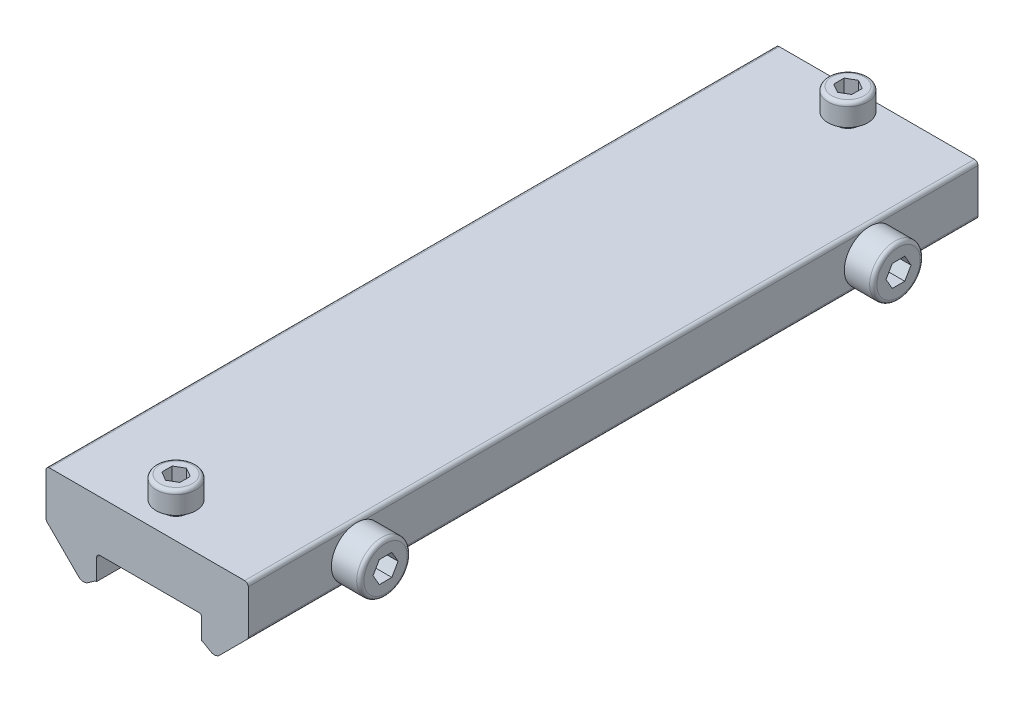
ISO-10303-21;
HEADER;
FILE_DESCRIPTION(('STEP AP214'),'2;1');
FILE_NAME('part.step','',(''),(''),'','','');
FILE_SCHEMA(('AUTOMOTIVE_DESIGN { 1 0 10303 214 1 1 1 1 }'));
ENDSEC;
DATA;
#1=APPLICATION_CONTEXT('core data for automotive mechanical design processes');
#2=APPLICATION_PROTOCOL_DEFINITION('international standard','automotive_design',2000,#1);
#3=PRODUCT_CONTEXT('',#1,'mechanical');
#4=PRODUCT('Part','Part','',(#3));
#5=PRODUCT_RELATED_PRODUCT_CATEGORY('part','',(#4));
#6=PRODUCT_DEFINITION_FORMATION('','',#4);
#7=PRODUCT_DEFINITION_CONTEXT('part definition',#1,'design');
#8=PRODUCT_DEFINITION('design','',#6,#7);
#9=PRODUCT_DEFINITION_SHAPE('','',#8);
#10=(LENGTH_UNIT() NAMED_UNIT(*) SI_UNIT(.MILLI.,.METRE.));
#11=(NAMED_UNIT(*) PLANE_ANGLE_UNIT() SI_UNIT($,.RADIAN.));
#12=(NAMED_UNIT(*) SI_UNIT($,.STERADIAN.) SOLID_ANGLE_UNIT());
#13=UNCERTAINTY_MEASURE_WITH_UNIT(LENGTH_MEASURE(1.E-05),#10,'distance_accuracy_value','');
#14=(GEOMETRIC_REPRESENTATION_CONTEXT(3) GLOBAL_UNCERTAINTY_ASSIGNED_CONTEXT((#13)) GLOBAL_UNIT_ASSIGNED_CONTEXT((#10,
#11,#12)) REPRESENTATION_CONTEXT('',''));
#15=CARTESIAN_POINT('',(0.,0.,0.));
#16=DIRECTION('',(0.,0.,1.));
#17=DIRECTION('',(1.,0.,0.));
#18=AXIS2_PLACEMENT_3D('',#15,#16,#17);
#19=CARTESIAN_POINT('',(0.5,0.,50.5));
#20=DIRECTION('',(0.,-1.,0.));
#21=DIRECTION('',(1.,0.,0.));
#22=AXIS2_PLACEMENT_3D('',#19,#20,#21);
#23=PLANE('',#22);
#24=CARTESIAN_POINT('',(-4.,0.,-46.5));
#25=DIRECTION('',(0.,-1.,0.));
#26=DIRECTION('',(1.,0.,0.));
#27=AXIS2_PLACEMENT_3D('',#24,#25,#26);
#28=CIRCLE('',#27,1.5);
#29=CARTESIAN_POINT('',(-2.5,0.,-46.5));
#30=VERTEX_POINT('',#29);
#31=EDGE_CURVE('E25',#30,#30,#28,.F.);
#32=ORIENTED_EDGE('',*,*,#31,.F.);
#33=EDGE_LOOP('',(#32));
#34=FACE_BOUND('',#33,.T.);
#35=DIRECTION('',(-1.,0.,0.));
#36=VECTOR('',#35,1.);
#37=CARTESIAN_POINT('',(0.5,0.,-50.5));
#38=LINE('',#37,#36);
#39=CARTESIAN_POINT('',(9.5,0.,-50.5));
#40=VERTEX_POINT('',#39);
#41=CARTESIAN_POINT('',(-17.5,0.,-50.5));
#42=VERTEX_POINT('',#41);
#43=EDGE_CURVE('E805',#40,#42,#38,.T.);
#44=ORIENTED_EDGE('',*,*,#43,.T.);
#45=DIRECTION('',(0.,0.,-1.));
#46=VECTOR('',#45,1.);
#47=CARTESIAN_POINT('',(-17.5,0.,50.5));
#48=LINE('',#47,#46);
#49=CARTESIAN_POINT('',(-17.5,0.,50.5));
#50=VERTEX_POINT('',#49);
#51=EDGE_CURVE('E693',#50,#42,#48,.T.);
#52=ORIENTED_EDGE('',*,*,#51,.F.);
#53=DIRECTION('',(-1.,0.,0.));
#54=VECTOR('',#53,1.);
#55=CARTESIAN_POINT('',(0.5,0.,50.5));
#56=LINE('',#55,#54);
#57=CARTESIAN_POINT('',(9.5,0.,50.5));
#58=VERTEX_POINT('',#57);
#59=EDGE_CURVE('E1066',#58,#50,#56,.T.);
#60=ORIENTED_EDGE('',*,*,#59,.F.);
#61=DIRECTION('',(0.,0.,-1.));
#62=VECTOR('',#61,1.);
#63=CARTESIAN_POINT('',(9.5,0.,50.5));
#64=LINE('',#63,#62);
#65=EDGE_CURVE('E815',#58,#40,#64,.T.);
#66=ORIENTED_EDGE('',*,*,#65,.T.);
#67=EDGE_LOOP('',(#44,#52,#60,#66));
#68=FACE_BOUND('',#67,.T.);
#69=CARTESIAN_POINT('',(-4.,0.,46.5));
#70=DIRECTION('',(0.,-1.,0.));
#71=DIRECTION('',(1.,0.,0.));
#72=AXIS2_PLACEMENT_3D('',#69,#70,#71);
#73=CIRCLE('',#72,1.5);
#74=CARTESIAN_POINT('',(-2.5,0.,46.5));
#75=VERTEX_POINT('',#74);
#76=EDGE_CURVE('E9',#75,#75,#73,.F.);
#77=ORIENTED_EDGE('',*,*,#76,.F.);
#78=EDGE_LOOP('',(#77));
#79=FACE_BOUND('',#78,.T.);
#80=ADVANCED_FACE('F16',(#34,#68,#79),#23,.F.);
#81=CARTESIAN_POINT('',(10.,-0.5,50.5));
#82=DIRECTION('',(-1.,0.,0.));
#83=DIRECTION('',(0.,-1.,0.));
#84=AXIS2_PLACEMENT_3D('',#81,#82,#83);
#85=PLANE('',#84);
#86=CARTESIAN_POINT('',(10.,-3.8,35.5));
#87=DIRECTION('',(1.,0.,0.));
#88=DIRECTION('',(0.,0.,-1.));
#89=AXIS2_PLACEMENT_3D('',#86,#87,#88);
#90=CIRCLE('',#89,3.5);
#91=CARTESIAN_POINT('',(10.,-6.50710678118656,33.2815381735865));
#92=VERTEX_POINT('',#91);
#93=CARTESIAN_POINT('',(10.,-0.5,34.3338096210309));
#94=VERTEX_POINT('',#93);
#95=EDGE_CURVE('E1116',#92,#94,#90,.T.);
#96=ORIENTED_EDGE('',*,*,#95,.F.);
#97=DIRECTION('',(0.,0.,-1.));
#98=VECTOR('',#97,1.);
#99=CARTESIAN_POINT('',(10.,-6.50710678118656,50.5));
#100=LINE('',#99,#98);
#101=CARTESIAN_POINT('',(10.,-6.50710678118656,-33.2815381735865));
#102=VERTEX_POINT('',#101);
#103=EDGE_CURVE('E829',#92,#102,#100,.T.);
#104=ORIENTED_EDGE('',*,*,#103,.T.);
#105=CARTESIAN_POINT('',(10.,-3.8,-35.5));
#106=DIRECTION('',(1.,0.,0.));
#107=DIRECTION('',(0.,0.,-1.));
#108=AXIS2_PLACEMENT_3D('',#105,#106,#107);
#109=CIRCLE('',#108,3.5);
#110=CARTESIAN_POINT('',(10.,-0.5,-34.3338096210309));
#111=VERTEX_POINT('',#110);
#112=EDGE_CURVE('E536',#111,#102,#109,.T.);
#113=ORIENTED_EDGE('',*,*,#112,.F.);
#114=DIRECTION('',(0.,0.,-1.));
#115=VECTOR('',#114,1.);
#116=CARTESIAN_POINT('',(10.,-0.5,50.5));
#117=LINE('',#116,#115);
#118=EDGE_CURVE('E824',#94,#111,#117,.T.);
#119=ORIENTED_EDGE('',*,*,#118,.F.);
#120=EDGE_LOOP('',(#96,#104,#113,#119));
#121=FACE_BOUND('',#120,.T.);
#122=ADVANCED_FACE('F720',(#121),#85,.F.);
#123=CARTESIAN_POINT('',(10.,-6.50710678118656,-37.7184618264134));
#124=VERTEX_POINT('',#123);
#125=CARTESIAN_POINT('',(10.,-0.5,-36.6661903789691));
#126=VERTEX_POINT('',#125);
#127=EDGE_CURVE('E531',#124,#126,#109,.T.);
#128=ORIENTED_EDGE('',*,*,#127,.F.);
#129=CARTESIAN_POINT('',(10.,-6.50710678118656,-50.5));
#130=VERTEX_POINT('',#129);
#131=EDGE_CURVE('E823',#124,#130,#100,.T.);
#132=ORIENTED_EDGE('',*,*,#131,.T.);
#133=DIRECTION('',(0.,1.,0.));
#134=VECTOR('',#133,1.);
#135=CARTESIAN_POINT('',(10.,-0.5,-50.5));
#136=LINE('',#135,#134);
#137=CARTESIAN_POINT('',(10.,-0.5,-50.5));
#138=VERTEX_POINT('',#137);
#139=EDGE_CURVE('E800',#130,#138,#136,.T.);
#140=ORIENTED_EDGE('',*,*,#139,.T.);
#141=EDGE_CURVE('E819',#126,#138,#117,.T.);
#142=ORIENTED_EDGE('',*,*,#141,.F.);
#143=EDGE_LOOP('',(#128,#132,#140,#142));
#144=FACE_BOUND('',#143,.T.);
#145=ADVANCED_FACE('F727',(#144),#85,.F.);
#146=CARTESIAN_POINT('',(3.7,-9.3,50.5));
#147=DIRECTION('',(0.,0.,-1.));
#148=DIRECTION('',(-1.,0.,0.));
#149=AXIS2_PLACEMENT_3D('',#146,#147,#148);
#150=CYLINDRICAL_SURFACE('',#149,0.9);
#151=CARTESIAN_POINT('',(3.7,-9.3,50.5));
#152=DIRECTION('',(0.,0.,1.));
#153=DIRECTION('',(-1.,0.,0.));
#154=AXIS2_PLACEMENT_3D('',#151,#152,#153);
#155=CIRCLE('',#154,0.9);
#156=CARTESIAN_POINT('',(3.5,-10.1774964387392,50.5));
#157=VERTEX_POINT('',#156);
#158=CARTESIAN_POINT('',(3.57142857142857,-10.1907689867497,50.5));
#159=VERTEX_POINT('',#158);
#160=EDGE_CURVE('E811',#157,#159,#155,.T.);
#161=ORIENTED_EDGE('',*,*,#160,.F.);
#162=DIRECTION('',(0.,0.,-1.));
#163=VECTOR('',#162,1.);
#164=CARTESIAN_POINT('',(3.5,-10.1774964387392,50.5));
#165=LINE('',#164,#163);
#166=CARTESIAN_POINT('',(3.5,-10.1774964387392,-50.5));
#167=VERTEX_POINT('',#166);
#168=EDGE_CURVE('E472',#157,#167,#165,.T.);
#169=ORIENTED_EDGE('',*,*,#168,.T.);
#170=CARTESIAN_POINT('',(3.7,-9.3,-50.5));
#171=DIRECTION('',(0.,0.,1.));
#172=DIRECTION('',(-1.,0.,0.));
#173=AXIS2_PLACEMENT_3D('',#170,#171,#172);
#174=CIRCLE('',#173,0.9);
#175=CARTESIAN_POINT('',(3.57142857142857,-10.1907689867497,-50.5));
#176=VERTEX_POINT('',#175);
#177=EDGE_CURVE('E780',#167,#176,#174,.T.);
#178=ORIENTED_EDGE('',*,*,#177,.T.);
#179=DIRECTION('',(0.,0.,-1.));
#180=VECTOR('',#179,1.);
#181=CARTESIAN_POINT('',(3.57142857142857,-10.1907689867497,50.5));
#182=LINE('',#181,#180);
#183=EDGE_CURVE('E775',#159,#176,#182,.T.);
#184=ORIENTED_EDGE('',*,*,#183,.F.);
#185=EDGE_LOOP('',(#161,#169,#178,#184));
#186=FACE_BOUND('',#185,.T.);
#187=ADVANCED_FACE('F18',(#186),#150,.T.);
#188=CARTESIAN_POINT('',(3.5,-10.6856406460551,50.5));
#189=DIRECTION('',(0.,0.,-1.));
#190=DIRECTION('',(-1.,0.,0.));
#191=AXIS2_PLACEMENT_3D('',#188,#189,#190);
#192=CYLINDRICAL_SURFACE('',#191,0.5);
#193=CARTESIAN_POINT('',(3.5,-10.6856406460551,-50.5));
#194=DIRECTION('',(0.,0.,-1.));
#195=DIRECTION('',(1.,0.,0.));
#196=AXIS2_PLACEMENT_3D('',#193,#194,#195);
#197=CIRCLE('',#196,0.5);
#198=CARTESIAN_POINT('',(3.75221778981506,-10.2539159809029,-50.5));
#199=VERTEX_POINT('',#198);
#200=EDGE_CURVE('E769',#176,#199,#197,.T.);
#201=ORIENTED_EDGE('',*,*,#200,.T.);
#202=DIRECTION('',(0.,0.,-1.));
#203=VECTOR('',#202,1.);
#204=CARTESIAN_POINT('',(3.75221778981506,-10.2539159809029,50.5));
#205=LINE('',#204,#203);
#206=CARTESIAN_POINT('',(3.75221778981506,-10.2539159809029,50.5));
#207=VERTEX_POINT('',#206);
#208=EDGE_CURVE('E772',#207,#199,#205,.T.);
#209=ORIENTED_EDGE('',*,*,#208,.F.);
#210=CARTESIAN_POINT('',(3.5,-10.6856406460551,50.5));
#211=DIRECTION('',(0.,0.,-1.));
#212=DIRECTION('',(1.,0.,0.));
#213=AXIS2_PLACEMENT_3D('',#210,#211,#212);
#214=CIRCLE('',#213,0.5);
#215=EDGE_CURVE('E1053',#159,#207,#214,.T.);
#216=ORIENTED_EDGE('',*,*,#215,.F.);
#217=ORIENTED_EDGE('',*,*,#183,.T.);
#218=EDGE_LOOP('',(#201,#209,#216,#217));
#219=FACE_BOUND('',#218,.T.);
#220=ADVANCED_FACE('F757',(#219),#192,.F.);
#221=CARTESIAN_POINT('',(4.79556442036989,-10.8634493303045,50.5));
#222=DIRECTION('',(0.50443557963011,0.863449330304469,0.));
#223=DIRECTION('',(-0.863449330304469,0.50443557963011,0.));
#224=AXIS2_PLACEMENT_3D('',#221,#222,#223);
#225=PLANE('',#224);
#226=DIRECTION('',(0.863449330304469,-0.50443557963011,0.));
#227=VECTOR('',#226,1.);
#228=CARTESIAN_POINT('',(4.79556442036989,-10.8634493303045,-50.5));
#229=LINE('',#228,#227);
#230=CARTESIAN_POINT('',(4.79556442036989,-10.8634493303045,-50.5));
#231=VERTEX_POINT('',#230);
#232=EDGE_CURVE('E779',#199,#231,#229,.T.);
#233=ORIENTED_EDGE('',*,*,#232,.T.);
#234=DIRECTION('',(0.,0.,-1.));
#235=VECTOR('',#234,1.);
#236=CARTESIAN_POINT('',(4.79556442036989,-10.8634493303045,50.5));
#237=LINE('',#236,#235);
#238=CARTESIAN_POINT('',(4.79556442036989,-10.8634493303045,50.5));
#239=VERTEX_POINT('',#238);
#240=EDGE_CURVE('E785',#239,#231,#237,.T.);
#241=ORIENTED_EDGE('',*,*,#240,.F.);
#242=DIRECTION('',(0.863449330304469,-0.50443557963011,0.));
#243=VECTOR('',#242,1.);
#244=CARTESIAN_POINT('',(4.79556442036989,-10.8634493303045,50.5));
#245=LINE('',#244,#243);
#246=EDGE_CURVE('E784',#207,#239,#245,.T.);
#247=ORIENTED_EDGE('',*,*,#246,.F.);
#248=ORIENTED_EDGE('',*,*,#208,.T.);
#249=EDGE_LOOP('',(#233,#241,#247,#248));
#250=FACE_BOUND('',#249,.T.);
#251=ADVANCED_FACE('F754',(#250),#225,.F.);
#252=CARTESIAN_POINT('',(5.3,-10.,50.5));
#253=DIRECTION('',(0.,0.,-1.));
#254=DIRECTION('',(-1.,0.,0.));
#255=AXIS2_PLACEMENT_3D('',#252,#253,#254);
#256=CYLINDRICAL_SURFACE('',#255,1.);
#257=CARTESIAN_POINT('',(5.3,-10.,-50.5));
#258=DIRECTION('',(0.,0.,1.));
#259=DIRECTION('',(-1.,0.,0.));
#260=AXIS2_PLACEMENT_3D('',#257,#258,#259);
#261=CIRCLE('',#260,1.);
#262=CARTESIAN_POINT('',(6.00710678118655,-10.7071067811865,-50.5));
#263=VERTEX_POINT('',#262);
#264=EDGE_CURVE('E790',#231,#263,#261,.T.);
#265=ORIENTED_EDGE('',*,*,#264,.T.);
#266=DIRECTION('',(0.,0.,-1.));
#267=VECTOR('',#266,1.);
#268=CARTESIAN_POINT('',(6.00710678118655,-10.7071067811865,50.5));
#269=LINE('',#268,#267);
#270=CARTESIAN_POINT('',(6.00710678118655,-10.7071067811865,50.5));
#271=VERTEX_POINT('',#270);
#272=EDGE_CURVE('E832',#271,#263,#269,.T.);
#273=ORIENTED_EDGE('',*,*,#272,.F.);
#274=CARTESIAN_POINT('',(5.3,-10.,50.5));
#275=DIRECTION('',(0.,0.,1.));
#276=DIRECTION('',(-1.,0.,0.));
#277=AXIS2_PLACEMENT_3D('',#274,#275,#276);
#278=CIRCLE('',#277,1.);
#279=EDGE_CURVE('E1056',#239,#271,#278,.T.);
#280=ORIENTED_EDGE('',*,*,#279,.F.);
#281=ORIENTED_EDGE('',*,*,#240,.T.);
#282=EDGE_LOOP('',(#265,#273,#280,#281));
#283=FACE_BOUND('',#282,.T.);
#284=ADVANCED_FACE('F750',(#283),#256,.T.);
#285=CARTESIAN_POINT('',(9.85355339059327,-6.86066017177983,50.5));
#286=DIRECTION('',(-0.707106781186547,0.707106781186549,0.));
#287=DIRECTION('',(-0.707106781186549,-0.707106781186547,0.));
#288=AXIS2_PLACEMENT_3D('',#285,#286,#287);
#289=PLANE('',#288);
#290=DIRECTION('',(0.707106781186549,0.707106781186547,0.));
#291=VECTOR('',#290,1.);
#292=CARTESIAN_POINT('',(9.85355339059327,-6.86066017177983,-50.5));
#293=LINE('',#292,#291);
#294=CARTESIAN_POINT('',(9.85355339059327,-6.86066017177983,-50.5));
#295=VERTEX_POINT('',#294);
#296=EDGE_CURVE('E792',#263,#295,#293,.T.);
#297=ORIENTED_EDGE('',*,*,#296,.T.);
#298=DIRECTION('',(0.,0.,-1.));
#299=VECTOR('',#298,1.);
#300=CARTESIAN_POINT('',(9.85355339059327,-6.86066017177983,50.5));
#301=LINE('',#300,#299);
#302=CARTESIAN_POINT('',(9.85355339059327,-6.86066017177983,50.5));
#303=VERTEX_POINT('',#302);
#304=EDGE_CURVE('E828',#303,#295,#301,.T.);
#305=ORIENTED_EDGE('',*,*,#304,.F.);
#306=DIRECTION('',(0.707106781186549,0.707106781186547,0.));
#307=VECTOR('',#306,1.);
#308=CARTESIAN_POINT('',(9.85355339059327,-6.86066017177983,50.5));
#309=LINE('',#308,#307);
#310=EDGE_CURVE('E1058',#271,#303,#309,.T.);
#311=ORIENTED_EDGE('',*,*,#310,.F.);
#312=ORIENTED_EDGE('',*,*,#272,.T.);
#313=EDGE_LOOP('',(#297,#305,#311,#312));
#314=FACE_BOUND('',#313,.T.);
#315=ADVANCED_FACE('F746',(#314),#289,.F.);
#316=CARTESIAN_POINT('',(9.5,-6.50710678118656,50.5));
#317=DIRECTION('',(0.,0.,-1.));
#318=DIRECTION('',(-1.,0.,0.));
#319=AXIS2_PLACEMENT_3D('',#316,#317,#318);
#320=CYLINDRICAL_SURFACE('',#319,0.5);
#321=CARTESIAN_POINT('',(9.5,-6.50710678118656,-50.5));
#322=DIRECTION('',(0.,0.,1.));
#323=DIRECTION('',(-1.,0.,0.));
#324=AXIS2_PLACEMENT_3D('',#321,#322,#323);
#325=CIRCLE('',#324,0.5);
#326=EDGE_CURVE('E797',#295,#130,#325,.T.);
#327=ORIENTED_EDGE('',*,*,#326,.T.);
#328=ORIENTED_EDGE('',*,*,#131,.F.);
#329=DIRECTION('',(0.,0.,-1.));
#330=VECTOR('',#329,1.);
#331=CARTESIAN_POINT('',(10.,-6.50710678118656,50.5));
#332=LINE('',#331,#330);
#333=EDGE_CURVE('E1041',#102,#124,#332,.T.);
#334=ORIENTED_EDGE('',*,*,#333,.F.);
#335=ORIENTED_EDGE('',*,*,#103,.F.);
#336=DIRECTION('',(0.,0.,-1.));
#337=VECTOR('',#336,1.);
#338=CARTESIAN_POINT('',(10.,-6.50710678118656,50.5));
#339=LINE('',#338,#337);
#340=CARTESIAN_POINT('',(10.,-6.50710678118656,37.7184618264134));
#341=VERTEX_POINT('',#340);
#342=EDGE_CURVE('E1044',#341,#92,#339,.T.);
#343=ORIENTED_EDGE('',*,*,#342,.F.);
#344=CARTESIAN_POINT('',(10.,-6.50710678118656,50.5));
#345=VERTEX_POINT('',#344);
#346=EDGE_CURVE('E825',#345,#341,#100,.T.);
#347=ORIENTED_EDGE('',*,*,#346,.F.);
#348=CARTESIAN_POINT('',(9.5,-6.50710678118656,50.5));
#349=DIRECTION('',(0.,0.,1.));
#350=DIRECTION('',(-1.,0.,0.));
#351=AXIS2_PLACEMENT_3D('',#348,#349,#350);
#352=CIRCLE('',#351,0.5);
#353=EDGE_CURVE('E1060',#303,#345,#352,.T.);
#354=ORIENTED_EDGE('',*,*,#353,.F.);
#355=ORIENTED_EDGE('',*,*,#304,.T.);
#356=EDGE_LOOP('',(#327,#328,#334,#335,#343,#347,#354,#355));
#357=FACE_BOUND('',#356,.T.);
#358=ADVANCED_FACE('F742',(#357),#320,.T.);
#359=CARTESIAN_POINT('',(10.,-0.5,36.6661903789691));
#360=VERTEX_POINT('',#359);
#361=EDGE_CURVE('E1107',#360,#341,#90,.T.);
#362=ORIENTED_EDGE('',*,*,#361,.F.);
#363=CARTESIAN_POINT('',(10.,-0.5,50.5));
#364=VERTEX_POINT('',#363);
#365=EDGE_CURVE('E820',#364,#360,#117,.T.);
#366=ORIENTED_EDGE('',*,*,#365,.F.);
#367=DIRECTION('',(0.,1.,0.));
#368=VECTOR('',#367,1.);
#369=CARTESIAN_POINT('',(10.,-0.5,50.5));
#370=LINE('',#369,#368);
#371=EDGE_CURVE('E1062',#345,#364,#370,.T.);
#372=ORIENTED_EDGE('',*,*,#371,.F.);
#373=ORIENTED_EDGE('',*,*,#346,.T.);
#374=EDGE_LOOP('',(#362,#366,#372,#373));
#375=FACE_BOUND('',#374,.T.);
#376=ADVANCED_FACE('F730',(#375),#85,.F.);
#377=CARTESIAN_POINT('',(9.5,-0.5,50.5));
#378=DIRECTION('',(0.,0.,-1.));
#379=DIRECTION('',(-1.,0.,0.));
#380=AXIS2_PLACEMENT_3D('',#377,#378,#379);
#381=CYLINDRICAL_SURFACE('',#380,0.5);
#382=CARTESIAN_POINT('',(9.5,-0.5,-50.5));
#383=DIRECTION('',(0.,0.,1.));
#384=DIRECTION('',(-1.,0.,0.));
#385=AXIS2_PLACEMENT_3D('',#382,#383,#384);
#386=CIRCLE('',#385,0.5);
#387=EDGE_CURVE('E803',#138,#40,#386,.T.);
#388=ORIENTED_EDGE('',*,*,#387,.T.);
#389=ORIENTED_EDGE('',*,*,#65,.F.);
#390=CARTESIAN_POINT('',(9.5,-0.5,50.5));
#391=DIRECTION('',(0.,0.,1.));
#392=DIRECTION('',(-1.,0.,0.));
#393=AXIS2_PLACEMENT_3D('',#390,#391,#392);
#394=CIRCLE('',#393,0.5);
#395=EDGE_CURVE('E1064',#364,#58,#394,.T.);
#396=ORIENTED_EDGE('',*,*,#395,.F.);
#397=ORIENTED_EDGE('',*,*,#365,.T.);
#398=DIRECTION('',(0.,0.,-1.));
#399=VECTOR('',#398,1.);
#400=CARTESIAN_POINT('',(10.,-0.5,50.5));
#401=LINE('',#400,#399);
#402=EDGE_CURVE('E935',#360,#94,#401,.T.);
#403=ORIENTED_EDGE('',*,*,#402,.T.);
#404=ORIENTED_EDGE('',*,*,#118,.T.);
#405=DIRECTION('',(0.,0.,-1.));
#406=VECTOR('',#405,1.);
#407=CARTESIAN_POINT('',(10.,-0.5,50.5));
#408=LINE('',#407,#406);
#409=EDGE_CURVE('E934',#111,#126,#408,.T.);
#410=ORIENTED_EDGE('',*,*,#409,.T.);
#411=ORIENTED_EDGE('',*,*,#141,.T.);
#412=EDGE_LOOP('',(#388,#389,#396,#397,#403,#404,#410,#411));
#413=FACE_BOUND('',#412,.T.);
#414=ADVANCED_FACE('F737',(#413),#381,.T.);
#415=CARTESIAN_POINT('',(3.,-7.3,50.5));
#416=DIRECTION('',(0.,0.,-1.));
#417=DIRECTION('',(-1.,0.,0.));
#418=AXIS2_PLACEMENT_3D('',#415,#416,#417);
#419=CYLINDRICAL_SURFACE('',#418,0.5);
#420=CARTESIAN_POINT('',(3.,-7.3,50.5));
#421=DIRECTION('',(0.,0.,-1.));
#422=DIRECTION('',(1.,0.,0.));
#423=AXIS2_PLACEMENT_3D('',#420,#421,#422);
#424=CIRCLE('',#423,0.5);
#425=CARTESIAN_POINT('',(3.4,-7.,50.5));
#426=VERTEX_POINT('',#425);
#427=CARTESIAN_POINT('',(3.5,-7.3,50.5));
#428=VERTEX_POINT('',#427);
#429=EDGE_CURVE('E1068',#426,#428,#424,.T.);
#430=ORIENTED_EDGE('',*,*,#429,.F.);
#431=DIRECTION('',(0.,0.,-1.));
#432=VECTOR('',#431,1.);
#433=CARTESIAN_POINT('',(3.4,-7.,50.5));
#434=LINE('',#433,#432);
#435=CARTESIAN_POINT('',(3.4,-7.,-50.5));
#436=VERTEX_POINT('',#435);
#437=EDGE_CURVE('E470',#426,#436,#434,.T.);
#438=ORIENTED_EDGE('',*,*,#437,.T.);
#439=CARTESIAN_POINT('',(3.,-7.3,-50.5));
#440=DIRECTION('',(0.,0.,-1.));
#441=DIRECTION('',(1.,0.,0.));
#442=AXIS2_PLACEMENT_3D('',#439,#440,#441);
#443=CIRCLE('',#442,0.5);
#444=CARTESIAN_POINT('',(3.5,-7.3,-50.5));
#445=VERTEX_POINT('',#444);
#446=EDGE_CURVE('E807',#436,#445,#443,.T.);
#447=ORIENTED_EDGE('',*,*,#446,.T.);
#448=DIRECTION('',(0.,0.,-1.));
#449=VECTOR('',#448,1.);
#450=CARTESIAN_POINT('',(3.5,-7.3,50.5));
#451=LINE('',#450,#449);
#452=EDGE_CURVE('E812',#428,#445,#451,.T.);
#453=ORIENTED_EDGE('',*,*,#452,.F.);
#454=EDGE_LOOP('',(#430,#438,#447,#453));
#455=FACE_BOUND('',#454,.T.);
#456=ADVANCED_FACE('F735',(#455),#419,.F.);
#457=CARTESIAN_POINT('',(3.5,-8.08756443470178,50.5));
#458=DIRECTION('',(1.,0.,0.));
#459=DIRECTION('',(0.,0.,-1.));
#460=AXIS2_PLACEMENT_3D('',#457,#458,#459);
#461=PLANE('',#460);
#462=DIRECTION('',(0.,-1.,0.));
#463=VECTOR('',#462,1.);
#464=CARTESIAN_POINT('',(3.5,-8.08756443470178,-50.5));
#465=LINE('',#464,#463);
#466=EDGE_CURVE('E809',#445,#167,#465,.T.);
#467=ORIENTED_EDGE('',*,*,#466,.T.);
#468=ORIENTED_EDGE('',*,*,#168,.F.);
#469=DIRECTION('',(0.,-1.,0.));
#470=VECTOR('',#469,1.);
#471=CARTESIAN_POINT('',(3.5,-8.08756443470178,50.5));
#472=LINE('',#471,#470);
#473=EDGE_CURVE('E816',#428,#157,#472,.T.);
#474=ORIENTED_EDGE('',*,*,#473,.F.);
#475=ORIENTED_EDGE('',*,*,#452,.T.);
#476=EDGE_LOOP('',(#467,#468,#474,#475));
#477=FACE_BOUND('',#476,.T.);
#478=ADVANCED_FACE('F1074',(#477),#461,.F.);
#479=CARTESIAN_POINT('',(3.,-8.08756443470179,50.5));
#480=DIRECTION('',(0.,0.,1.));
#481=DIRECTION('',(1.,0.,0.));
#482=AXIS2_PLACEMENT_3D('',#479,#480,#481);
#483=PLANE('',#482);
#484=DIRECTION('',(1.,0.,0.));
#485=VECTOR('',#484,1.);
#486=CARTESIAN_POINT('',(-4.3,-7.,50.5));
#487=LINE('',#486,#485);
#488=CARTESIAN_POINT('',(-10.5,-7.,50.5));
#489=VERTEX_POINT('',#488);
#490=EDGE_CURVE('E32',#489,#426,#487,.T.);
#491=ORIENTED_EDGE('',*,*,#490,.T.);
#492=ORIENTED_EDGE('',*,*,#429,.T.);
#493=ORIENTED_EDGE('',*,*,#473,.T.);
#494=ORIENTED_EDGE('',*,*,#160,.T.);
#495=ORIENTED_EDGE('',*,*,#215,.T.);
#496=ORIENTED_EDGE('',*,*,#246,.T.);
#497=ORIENTED_EDGE('',*,*,#279,.T.);
#498=ORIENTED_EDGE('',*,*,#310,.T.);
#499=ORIENTED_EDGE('',*,*,#353,.T.);
#500=ORIENTED_EDGE('',*,*,#371,.T.);
#501=ORIENTED_EDGE('',*,*,#395,.T.);
#502=ORIENTED_EDGE('',*,*,#59,.T.);
#503=CARTESIAN_POINT('',(-17.5,-0.5,50.5));
#504=DIRECTION('',(0.,0.,1.));
#505=DIRECTION('',(-1.,0.,0.));
#506=AXIS2_PLACEMENT_3D('',#503,#504,#505);
#507=CIRCLE('',#506,0.5);
#508=CARTESIAN_POINT('',(-18.,-0.5,50.5));
#509=VERTEX_POINT('',#508);
#510=EDGE_CURVE('E953',#50,#509,#507,.T.);
#511=ORIENTED_EDGE('',*,*,#510,.T.);
#512=DIRECTION('',(0.,-1.,0.));
#513=VECTOR('',#512,1.);
#514=CARTESIAN_POINT('',(-18.,-6.30710678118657,50.5));
#515=LINE('',#514,#513);
#516=CARTESIAN_POINT('',(-18.,-6.30710678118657,50.5));
#517=VERTEX_POINT('',#516);
#518=EDGE_CURVE('E1020',#509,#517,#515,.T.);
#519=ORIENTED_EDGE('',*,*,#518,.T.);
#520=CARTESIAN_POINT('',(-17.5,-6.30710678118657,50.5));
#521=DIRECTION('',(0.,0.,1.));
#522=DIRECTION('',(-1.,0.,0.));
#523=AXIS2_PLACEMENT_3D('',#520,#521,#522);
#524=CIRCLE('',#523,0.5);
#525=CARTESIAN_POINT('',(-17.8535533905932,-6.66066017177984,50.5));
#526=VERTEX_POINT('',#525);
#527=EDGE_CURVE('E1018',#517,#526,#524,.T.);
#528=ORIENTED_EDGE('',*,*,#527,.T.);
#529=DIRECTION('',(0.707106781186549,-0.707106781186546,0.));
#530=VECTOR('',#529,1.);
#531=CARTESIAN_POINT('',(-13.5071067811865,-11.0071067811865,50.5));
#532=LINE('',#531,#530);
#533=CARTESIAN_POINT('',(-13.5071067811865,-11.0071067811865,50.5));
#534=VERTEX_POINT('',#533);
#535=EDGE_CURVE('E1016',#526,#534,#532,.T.);
#536=ORIENTED_EDGE('',*,*,#535,.T.);
#537=CARTESIAN_POINT('',(-12.8,-10.3,50.5));
#538=DIRECTION('',(0.,0.,1.));
#539=DIRECTION('',(-1.,0.,0.));
#540=AXIS2_PLACEMENT_3D('',#537,#538,#539);
#541=CIRCLE('',#540,1.);
#542=CARTESIAN_POINT('',(-12.226423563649,-11.119152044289,50.5));
#543=VERTEX_POINT('',#542);
#544=EDGE_CURVE('E1014',#534,#543,#541,.T.);
#545=ORIENTED_EDGE('',*,*,#544,.T.);
#546=DIRECTION('',(0.819152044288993,0.573576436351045,0.));
#547=VECTOR('',#546,1.);
#548=CARTESIAN_POINT('',(-11.313051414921,-10.4796019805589,50.5));
#549=LINE('',#548,#547);
#550=CARTESIAN_POINT('',(-11.313051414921,-10.4796019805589,50.5));
#551=VERTEX_POINT('',#550);
#552=EDGE_CURVE('E1012',#543,#551,#549,.T.);
#553=ORIENTED_EDGE('',*,*,#552,.T.);
#554=CARTESIAN_POINT('',(-11.0262631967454,-10.8891780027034,50.5));
#555=DIRECTION('',(0.,0.,-1.));
#556=DIRECTION('',(1.,0.,0.));
#557=AXIS2_PLACEMENT_3D('',#554,#555,#556);
#558=CIRCLE('',#557,0.5);
#559=CARTESIAN_POINT('',(-11.0883120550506,-10.3930430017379,50.5));
#560=VERTEX_POINT('',#559);
#561=EDGE_CURVE('E1010',#551,#560,#558,.T.);
#562=ORIENTED_EDGE('',*,*,#561,.T.);
#563=CARTESIAN_POINT('',(-11.2,-9.5,50.5));
#564=DIRECTION('',(0.,0.,1.));
#565=DIRECTION('',(-1.,0.,0.));
#566=AXIS2_PLACEMENT_3D('',#563,#564,#565);
#567=CIRCLE('',#566,0.9);
#568=CARTESIAN_POINT('',(-11.,-10.3774964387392,50.5));
#569=VERTEX_POINT('',#568);
#570=EDGE_CURVE('E1007',#560,#569,#567,.T.);
#571=ORIENTED_EDGE('',*,*,#570,.T.);
#572=DIRECTION('',(0.,1.,0.));
#573=VECTOR('',#572,1.);
#574=CARTESIAN_POINT('',(-11.,-7.5,50.5));
#575=LINE('',#574,#573);
#576=CARTESIAN_POINT('',(-11.,-7.5,50.5));
#577=VERTEX_POINT('',#576);
#578=EDGE_CURVE('E1005',#569,#577,#575,.T.);
#579=ORIENTED_EDGE('',*,*,#578,.T.);
#580=CARTESIAN_POINT('',(-10.5,-7.5,50.5));
#581=DIRECTION('',(0.,0.,-1.));
#582=DIRECTION('',(1.,0.,0.));
#583=AXIS2_PLACEMENT_3D('',#580,#581,#582);
#584=CIRCLE('',#583,0.5);
#585=EDGE_CURVE('E1003',#577,#489,#584,.T.);
#586=ORIENTED_EDGE('',*,*,#585,.T.);
#587=EDGE_LOOP('',(#491,#492,#493,#494,#495,#496,#497,#498,#499,#500,#501,#502,#511,#519,#528,
#536,#545,#553,#562,#571,#579,#586));
#588=FACE_BOUND('',#587,.T.);
#589=ADVANCED_FACE('F1101',(#588),#483,.T.);
#590=CARTESIAN_POINT('',(3.,-8.08756443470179,-50.5));
#591=DIRECTION('',(0.,0.,1.));
#592=DIRECTION('',(1.,0.,0.));
#593=AXIS2_PLACEMENT_3D('',#590,#591,#592);
#594=PLANE('',#593);
#595=ORIENTED_EDGE('',*,*,#446,.F.);
#596=DIRECTION('',(1.,0.,0.));
#597=VECTOR('',#596,1.);
#598=CARTESIAN_POINT('',(-4.3,-7.,-50.5));
#599=LINE('',#598,#597);
#600=CARTESIAN_POINT('',(-10.5,-7.,-50.5));
#601=VERTEX_POINT('',#600);
#602=EDGE_CURVE('E40',#601,#436,#599,.T.);
#603=ORIENTED_EDGE('',*,*,#602,.F.);
#604=CARTESIAN_POINT('',(-10.5,-7.5,-50.5));
#605=DIRECTION('',(0.,0.,-1.));
#606=DIRECTION('',(1.,0.,0.));
#607=AXIS2_PLACEMENT_3D('',#604,#605,#606);
#608=CIRCLE('',#607,0.5);
#609=CARTESIAN_POINT('',(-11.,-7.5,-50.5));
#610=VERTEX_POINT('',#609);
#611=EDGE_CURVE('E981',#610,#601,#608,.T.);
#612=ORIENTED_EDGE('',*,*,#611,.F.);
#613=DIRECTION('',(0.,1.,0.));
#614=VECTOR('',#613,1.);
#615=CARTESIAN_POINT('',(-11.,-7.5,-50.5));
#616=LINE('',#615,#614);
#617=CARTESIAN_POINT('',(-11.,-10.3774964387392,-50.5));
#618=VERTEX_POINT('',#617);
#619=EDGE_CURVE('E983',#618,#610,#616,.T.);
#620=ORIENTED_EDGE('',*,*,#619,.F.);
#621=CARTESIAN_POINT('',(-11.2,-9.5,-50.5));
#622=DIRECTION('',(0.,0.,1.));
#623=DIRECTION('',(-1.,0.,0.));
#624=AXIS2_PLACEMENT_3D('',#621,#622,#623);
#625=CIRCLE('',#624,0.9);
#626=CARTESIAN_POINT('',(-11.0883120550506,-10.3930430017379,-50.5));
#627=VERTEX_POINT('',#626);
#628=EDGE_CURVE('E985',#627,#618,#625,.T.);
#629=ORIENTED_EDGE('',*,*,#628,.F.);
#630=CARTESIAN_POINT('',(-11.0262631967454,-10.8891780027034,-50.5));
#631=DIRECTION('',(0.,0.,-1.));
#632=DIRECTION('',(1.,0.,0.));
#633=AXIS2_PLACEMENT_3D('',#630,#631,#632);
#634=CIRCLE('',#633,0.5);
#635=CARTESIAN_POINT('',(-11.313051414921,-10.4796019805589,-50.5));
#636=VERTEX_POINT('',#635);
#637=EDGE_CURVE('E988',#636,#627,#634,.T.);
#638=ORIENTED_EDGE('',*,*,#637,.F.);
#639=DIRECTION('',(0.819152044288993,0.573576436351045,0.));
#640=VECTOR('',#639,1.);
#641=CARTESIAN_POINT('',(-11.313051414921,-10.4796019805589,-50.5));
#642=LINE('',#641,#640);
#643=CARTESIAN_POINT('',(-12.226423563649,-11.119152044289,-50.5));
#644=VERTEX_POINT('',#643);
#645=EDGE_CURVE('E990',#644,#636,#642,.T.);
#646=ORIENTED_EDGE('',*,*,#645,.F.);
#647=CARTESIAN_POINT('',(-12.8,-10.3,-50.5));
#648=DIRECTION('',(0.,0.,1.));
#649=DIRECTION('',(-1.,0.,0.));
#650=AXIS2_PLACEMENT_3D('',#647,#648,#649);
#651=CIRCLE('',#650,1.);
#652=CARTESIAN_POINT('',(-13.5071067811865,-11.0071067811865,-50.5));
#653=VERTEX_POINT('',#652);
#654=EDGE_CURVE('E992',#653,#644,#651,.T.);
#655=ORIENTED_EDGE('',*,*,#654,.F.);
#656=DIRECTION('',(0.707106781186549,-0.707106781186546,0.));
#657=VECTOR('',#656,1.);
#658=CARTESIAN_POINT('',(-13.5071067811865,-11.0071067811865,-50.5));
#659=LINE('',#658,#657);
#660=CARTESIAN_POINT('',(-17.8535533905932,-6.66066017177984,-50.5));
#661=VERTEX_POINT('',#660);
#662=EDGE_CURVE('E994',#661,#653,#659,.T.);
#663=ORIENTED_EDGE('',*,*,#662,.F.);
#664=CARTESIAN_POINT('',(-17.5,-6.30710678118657,-50.5));
#665=DIRECTION('',(0.,0.,1.));
#666=DIRECTION('',(-1.,0.,0.));
#667=AXIS2_PLACEMENT_3D('',#664,#665,#666);
#668=CIRCLE('',#667,0.5);
#669=CARTESIAN_POINT('',(-18.,-6.30710678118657,-50.5));
#670=VERTEX_POINT('',#669);
#671=EDGE_CURVE('E996',#670,#661,#668,.T.);
#672=ORIENTED_EDGE('',*,*,#671,.F.);
#673=DIRECTION('',(0.,-1.,0.));
#674=VECTOR('',#673,1.);
#675=CARTESIAN_POINT('',(-18.,-6.30710678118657,-50.5));
#676=LINE('',#675,#674);
#677=CARTESIAN_POINT('',(-18.,-0.5,-50.5));
#678=VERTEX_POINT('',#677);
#679=EDGE_CURVE('E998',#678,#670,#676,.T.);
#680=ORIENTED_EDGE('',*,*,#679,.F.);
#681=CARTESIAN_POINT('',(-17.5,-0.5,-50.5));
#682=DIRECTION('',(0.,0.,1.));
#683=DIRECTION('',(-1.,0.,0.));
#684=AXIS2_PLACEMENT_3D('',#681,#682,#683);
#685=CIRCLE('',#684,0.5);
#686=EDGE_CURVE('E945',#42,#678,#685,.T.);
#687=ORIENTED_EDGE('',*,*,#686,.F.);
#688=ORIENTED_EDGE('',*,*,#43,.F.);
#689=ORIENTED_EDGE('',*,*,#387,.F.);
#690=ORIENTED_EDGE('',*,*,#139,.F.);
#691=ORIENTED_EDGE('',*,*,#326,.F.);
#692=ORIENTED_EDGE('',*,*,#296,.F.);
#693=ORIENTED_EDGE('',*,*,#264,.F.);
#694=ORIENTED_EDGE('',*,*,#232,.F.);
#695=ORIENTED_EDGE('',*,*,#200,.F.);
#696=ORIENTED_EDGE('',*,*,#177,.F.);
#697=ORIENTED_EDGE('',*,*,#466,.F.);
#698=EDGE_LOOP('',(#595,#603,#612,#620,#629,#638,#646,#655,#663,#672,#680,#687,#688,#689,#690,
#691,#692,#693,#694,#695,#696,#697));
#699=FACE_BOUND('',#698,.T.);
#700=ADVANCED_FACE('F618',(#699),#594,.F.);
#701=CARTESIAN_POINT('',(-17.5,-0.5,50.5));
#702=DIRECTION('',(0.,0.,-1.));
#703=DIRECTION('',(-1.,0.,0.));
#704=AXIS2_PLACEMENT_3D('',#701,#702,#703);
#705=CYLINDRICAL_SURFACE('',#704,0.5);
#706=ORIENTED_EDGE('',*,*,#686,.T.);
#707=DIRECTION('',(0.,0.,-1.));
#708=VECTOR('',#707,1.);
#709=CARTESIAN_POINT('',(-18.,-0.5,50.5));
#710=LINE('',#709,#708);
#711=EDGE_CURVE('E954',#509,#678,#710,.T.);
#712=ORIENTED_EDGE('',*,*,#711,.F.);
#713=ORIENTED_EDGE('',*,*,#510,.F.);
#714=ORIENTED_EDGE('',*,*,#51,.T.);
#715=EDGE_LOOP('',(#706,#712,#713,#714));
#716=FACE_BOUND('',#715,.T.);
#717=ADVANCED_FACE('F614',(#716),#705,.T.);
#718=CARTESIAN_POINT('',(-18.,-6.30710678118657,50.5));
#719=DIRECTION('',(1.,0.,0.));
#720=DIRECTION('',(0.,0.,-1.));
#721=AXIS2_PLACEMENT_3D('',#718,#719,#720);
#722=PLANE('',#721);
#723=ORIENTED_EDGE('',*,*,#679,.T.);
#724=DIRECTION('',(0.,0.,-1.));
#725=VECTOR('',#724,1.);
#726=CARTESIAN_POINT('',(-18.,-6.30710678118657,50.5));
#727=LINE('',#726,#725);
#728=EDGE_CURVE('E955',#517,#670,#727,.T.);
#729=ORIENTED_EDGE('',*,*,#728,.F.);
#730=ORIENTED_EDGE('',*,*,#518,.F.);
#731=ORIENTED_EDGE('',*,*,#711,.T.);
#732=EDGE_LOOP('',(#723,#729,#730,#731));
#733=FACE_BOUND('',#732,.T.);
#734=ADVANCED_FACE('F610',(#733),#722,.F.);
#735=CARTESIAN_POINT('',(-17.5,-6.30710678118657,50.5));
#736=DIRECTION('',(0.,0.,-1.));
#737=DIRECTION('',(-1.,0.,0.));
#738=AXIS2_PLACEMENT_3D('',#735,#736,#737);
#739=CYLINDRICAL_SURFACE('',#738,0.5);
#740=ORIENTED_EDGE('',*,*,#671,.T.);
#741=DIRECTION('',(0.,0.,-1.));
#742=VECTOR('',#741,1.);
#743=CARTESIAN_POINT('',(-17.8535533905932,-6.66066017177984,50.5));
#744=LINE('',#743,#742);
#745=EDGE_CURVE('E958',#526,#661,#744,.T.);
#746=ORIENTED_EDGE('',*,*,#745,.F.);
#747=ORIENTED_EDGE('',*,*,#527,.F.);
#748=ORIENTED_EDGE('',*,*,#728,.T.);
#749=EDGE_LOOP('',(#740,#746,#747,#748));
#750=FACE_BOUND('',#749,.T.);
#751=ADVANCED_FACE('F606',(#750),#739,.T.);
#752=CARTESIAN_POINT('',(-13.5071067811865,-11.0071067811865,50.5));
#753=DIRECTION('',(0.707106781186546,0.707106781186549,0.));
#754=DIRECTION('',(-0.707106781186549,0.707106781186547,0.));
#755=AXIS2_PLACEMENT_3D('',#752,#753,#754);
#756=PLANE('',#755);
#757=ORIENTED_EDGE('',*,*,#662,.T.);
#758=DIRECTION('',(0.,0.,-1.));
#759=VECTOR('',#758,1.);
#760=CARTESIAN_POINT('',(-13.5071067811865,-11.0071067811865,50.5));
#761=LINE('',#760,#759);
#762=EDGE_CURVE('E963',#534,#653,#761,.T.);
#763=ORIENTED_EDGE('',*,*,#762,.F.);
#764=ORIENTED_EDGE('',*,*,#535,.F.);
#765=ORIENTED_EDGE('',*,*,#745,.T.);
#766=EDGE_LOOP('',(#757,#763,#764,#765));
#767=FACE_BOUND('',#766,.T.);
#768=ADVANCED_FACE('F602',(#767),#756,.F.);
#769=CARTESIAN_POINT('',(-12.8,-10.3,50.5));
#770=DIRECTION('',(0.,0.,-1.));
#771=DIRECTION('',(-1.,0.,0.));
#772=AXIS2_PLACEMENT_3D('',#769,#770,#771);
#773=CYLINDRICAL_SURFACE('',#772,1.);
#774=ORIENTED_EDGE('',*,*,#654,.T.);
#775=DIRECTION('',(0.,0.,-1.));
#776=VECTOR('',#775,1.);
#777=CARTESIAN_POINT('',(-12.226423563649,-11.119152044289,50.5));
#778=LINE('',#777,#776);
#779=EDGE_CURVE('E966',#543,#644,#778,.T.);
#780=ORIENTED_EDGE('',*,*,#779,.F.);
#781=ORIENTED_EDGE('',*,*,#544,.F.);
#782=ORIENTED_EDGE('',*,*,#762,.T.);
#783=EDGE_LOOP('',(#774,#780,#781,#782));
#784=FACE_BOUND('',#783,.T.);
#785=ADVANCED_FACE('F598',(#784),#773,.T.);
#786=CARTESIAN_POINT('',(-11.313051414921,-10.4796019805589,50.5));
#787=DIRECTION('',(-0.573576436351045,0.819152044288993,0.));
#788=DIRECTION('',(-0.819152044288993,-0.573576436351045,0.));
#789=AXIS2_PLACEMENT_3D('',#786,#787,#788);
#790=PLANE('',#789);
#791=ORIENTED_EDGE('',*,*,#645,.T.);
#792=DIRECTION('',(0.,0.,-1.));
#793=VECTOR('',#792,1.);
#794=CARTESIAN_POINT('',(-11.313051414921,-10.4796019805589,50.5));
#795=LINE('',#794,#793);
#796=EDGE_CURVE('E969',#551,#636,#795,.T.);
#797=ORIENTED_EDGE('',*,*,#796,.F.);
#798=ORIENTED_EDGE('',*,*,#552,.F.);
#799=ORIENTED_EDGE('',*,*,#779,.T.);
#800=EDGE_LOOP('',(#791,#797,#798,#799));
#801=FACE_BOUND('',#800,.T.);
#802=ADVANCED_FACE('F594',(#801),#790,.F.);
#803=CARTESIAN_POINT('',(-11.0262631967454,-10.8891780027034,50.5));
#804=DIRECTION('',(0.,0.,-1.));
#805=DIRECTION('',(-1.,0.,0.));
#806=AXIS2_PLACEMENT_3D('',#803,#804,#805);
#807=CYLINDRICAL_SURFACE('',#806,0.5);
#808=ORIENTED_EDGE('',*,*,#637,.T.);
#809=DIRECTION('',(0.,0.,-1.));
#810=VECTOR('',#809,1.);
#811=CARTESIAN_POINT('',(-11.0883120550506,-10.3930430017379,50.5));
#812=LINE('',#811,#810);
#813=EDGE_CURVE('E972',#560,#627,#812,.T.);
#814=ORIENTED_EDGE('',*,*,#813,.F.);
#815=ORIENTED_EDGE('',*,*,#561,.F.);
#816=ORIENTED_EDGE('',*,*,#796,.T.);
#817=EDGE_LOOP('',(#808,#814,#815,#816));
#818=FACE_BOUND('',#817,.T.);
#819=ADVANCED_FACE('F590',(#818),#807,.F.);
#820=CARTESIAN_POINT('',(-11.2,-9.5,50.5));
#821=DIRECTION('',(0.,0.,-1.));
#822=DIRECTION('',(-1.,0.,0.));
#823=AXIS2_PLACEMENT_3D('',#820,#821,#822);
#824=CYLINDRICAL_SURFACE('',#823,0.9);
#825=ORIENTED_EDGE('',*,*,#628,.T.);
#826=DIRECTION('',(0.,0.,-1.));
#827=VECTOR('',#826,1.);
#828=CARTESIAN_POINT('',(-11.,-10.3774964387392,50.5));
#829=LINE('',#828,#827);
#830=EDGE_CURVE('E475',#618,#569,#829,.F.);
#831=ORIENTED_EDGE('',*,*,#830,.T.);
#832=ORIENTED_EDGE('',*,*,#570,.F.);
#833=ORIENTED_EDGE('',*,*,#813,.T.);
#834=EDGE_LOOP('',(#825,#831,#832,#833));
#835=FACE_BOUND('',#834,.T.);
#836=ADVANCED_FACE('F586',(#835),#824,.T.);
#837=CARTESIAN_POINT('',(-11.,-7.5,50.5));
#838=DIRECTION('',(-1.,0.,0.));
#839=DIRECTION('',(0.,-1.,0.));
#840=AXIS2_PLACEMENT_3D('',#837,#838,#839);
#841=PLANE('',#840);
#842=ORIENTED_EDGE('',*,*,#619,.T.);
#843=DIRECTION('',(0.,0.,-1.));
#844=VECTOR('',#843,1.);
#845=CARTESIAN_POINT('',(-11.,-7.5,50.5));
#846=LINE('',#845,#844);
#847=EDGE_CURVE('E975',#577,#610,#846,.T.);
#848=ORIENTED_EDGE('',*,*,#847,.F.);
#849=ORIENTED_EDGE('',*,*,#578,.F.);
#850=ORIENTED_EDGE('',*,*,#830,.F.);
#851=EDGE_LOOP('',(#842,#848,#849,#850));
#852=FACE_BOUND('',#851,.T.);
#853=ADVANCED_FACE('F582',(#852),#841,.F.);
#854=CARTESIAN_POINT('',(-10.5,-7.5,50.5));
#855=DIRECTION('',(0.,0.,-1.));
#856=DIRECTION('',(-1.,0.,0.));
#857=AXIS2_PLACEMENT_3D('',#854,#855,#856);
#858=CYLINDRICAL_SURFACE('',#857,0.5);
#859=ORIENTED_EDGE('',*,*,#611,.T.);
#860=DIRECTION('',(0.,0.,-1.));
#861=VECTOR('',#860,1.);
#862=CARTESIAN_POINT('',(-10.5,-7.,50.5));
#863=LINE('',#862,#861);
#864=EDGE_CURVE('E978',#489,#601,#863,.T.);
#865=ORIENTED_EDGE('',*,*,#864,.F.);
#866=ORIENTED_EDGE('',*,*,#585,.F.);
#867=ORIENTED_EDGE('',*,*,#847,.T.);
#868=EDGE_LOOP('',(#859,#865,#866,#867));
#869=FACE_BOUND('',#868,.T.);
#870=ADVANCED_FACE('F579',(#869),#858,.F.);
#871=CARTESIAN_POINT('',(-4.3,-7.,50.5));
#872=DIRECTION('',(0.,1.,0.));
#873=DIRECTION('',(-1.,0.,0.));
#874=AXIS2_PLACEMENT_3D('',#871,#872,#873);
#875=PLANE('',#874);
#876=ORIENTED_EDGE('',*,*,#602,.T.);
#877=ORIENTED_EDGE('',*,*,#437,.F.);
#878=ORIENTED_EDGE('',*,*,#490,.F.);
#879=ORIENTED_EDGE('',*,*,#864,.T.);
#880=EDGE_LOOP('',(#876,#877,#878,#879));
#881=FACE_BOUND('',#880,.T.);
#882=ADVANCED_FACE('F575',(#881),#875,.F.);
#883=CARTESIAN_POINT('',(11.,-3.8,-35.5));
#884=DIRECTION('',(1.,0.,0.));
#885=DIRECTION('',(0.,0.,-1.));
#886=AXIS2_PLACEMENT_3D('',#883,#884,#885);
#887=PLANE('',#886);
#888=DIRECTION('',(0.,-0.866025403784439,0.5));
#889=VECTOR('',#888,1.);
#890=CARTESIAN_POINT('',(11.,-2.3,-34.6339745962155));
#891=LINE('',#890,#889);
#892=CARTESIAN_POINT('',(11.,-2.3,-34.6339745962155));
#893=VERTEX_POINT('',#892);
#894=CARTESIAN_POINT('',(11.,-3.8,-33.7679491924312));
#895=VERTEX_POINT('',#894);
#896=EDGE_CURVE('E479',#893,#895,#891,.T.);
#897=ORIENTED_EDGE('',*,*,#896,.T.);
#898=DIRECTION('',(0.,-0.866025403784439,-0.5));
#899=VECTOR('',#898,1.);
#900=CARTESIAN_POINT('',(11.,-3.8,-33.7679491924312));
#901=LINE('',#900,#899);
#902=CARTESIAN_POINT('',(11.,-5.3,-34.6339745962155));
#903=VERTEX_POINT('',#902);
#904=EDGE_CURVE('E482',#895,#903,#901,.T.);
#905=ORIENTED_EDGE('',*,*,#904,.T.);
#906=DIRECTION('',(0.,0.,-1.));
#907=VECTOR('',#906,1.);
#908=CARTESIAN_POINT('',(11.,-5.3,-34.6339745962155));
#909=LINE('',#908,#907);
#910=CARTESIAN_POINT('',(11.,-5.3,-36.3660254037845));
#911=VERTEX_POINT('',#910);
#912=EDGE_CURVE('E486',#903,#911,#909,.T.);
#913=ORIENTED_EDGE('',*,*,#912,.T.);
#914=DIRECTION('',(0.,0.866025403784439,-0.5));
#915=VECTOR('',#914,1.);
#916=CARTESIAN_POINT('',(11.,-5.3,-36.3660254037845));
#917=LINE('',#916,#915);
#918=CARTESIAN_POINT('',(11.,-3.8,-37.2320508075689));
#919=VERTEX_POINT('',#918);
#920=EDGE_CURVE('E489',#911,#919,#917,.T.);
#921=ORIENTED_EDGE('',*,*,#920,.T.);
#922=DIRECTION('',(0.,0.866025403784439,0.5));
#923=VECTOR('',#922,1.);
#924=CARTESIAN_POINT('',(11.,-3.8,-37.2320508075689));
#925=LINE('',#924,#923);
#926=CARTESIAN_POINT('',(11.,-2.3,-36.3660254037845));
#927=VERTEX_POINT('',#926);
#928=EDGE_CURVE('E492',#919,#927,#925,.T.);
#929=ORIENTED_EDGE('',*,*,#928,.T.);
#930=DIRECTION('',(0.,0.,1.));
#931=VECTOR('',#930,1.);
#932=CARTESIAN_POINT('',(11.,-2.3,-36.3660254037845));
#933=LINE('',#932,#931);
#934=EDGE_CURVE('E495',#927,#893,#933,.T.);
#935=ORIENTED_EDGE('',*,*,#934,.T.);
#936=EDGE_LOOP('',(#897,#905,#913,#921,#929,#935));
#937=FACE_BOUND('',#936,.T.);
#938=ADVANCED_FACE('F578',(#937),#887,.T.);
#939=CARTESIAN_POINT('',(11.,-5.3,-34.6339745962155));
#940=DIRECTION('',(0.,-1.,0.));
#941=DIRECTION('',(0.,0.,-1.));
#942=AXIS2_PLACEMENT_3D('',#939,#940,#941);
#943=PLANE('',#942);
#944=DIRECTION('',(0.,0.,-1.));
#945=VECTOR('',#944,1.);
#946=CARTESIAN_POINT('',(14.,-5.3,-34.6339745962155));
#947=LINE('',#946,#945);
#948=CARTESIAN_POINT('',(14.,-5.3,-34.6339745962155));
#949=VERTEX_POINT('',#948);
#950=CARTESIAN_POINT('',(14.,-5.3,-36.3660254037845));
#951=VERTEX_POINT('',#950);
#952=EDGE_CURVE('E505',#949,#951,#947,.T.);
#953=ORIENTED_EDGE('',*,*,#952,.T.);
#954=DIRECTION('',(1.,0.,0.));
#955=VECTOR('',#954,1.);
#956=CARTESIAN_POINT('',(11.,-5.3,-36.3660254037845));
#957=LINE('',#956,#955);
#958=EDGE_CURVE('E523',#911,#951,#957,.T.);
#959=ORIENTED_EDGE('',*,*,#958,.F.);
#960=ORIENTED_EDGE('',*,*,#912,.F.);
#961=DIRECTION('',(1.,0.,0.));
#962=VECTOR('',#961,1.);
#963=CARTESIAN_POINT('',(11.,-5.3,-34.6339745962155));
#964=LINE('',#963,#962);
#965=EDGE_CURVE('E525',#903,#949,#964,.T.);
#966=ORIENTED_EDGE('',*,*,#965,.T.);
#967=EDGE_LOOP('',(#953,#959,#960,#966));
#968=FACE_BOUND('',#967,.T.);
#969=ADVANCED_FACE('F878',(#968),#943,.F.);
#970=CARTESIAN_POINT('',(11.,-5.3,-36.3660254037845));
#971=DIRECTION('',(0.,-0.5,-0.866025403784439));
#972=DIRECTION('',(0.,0.866025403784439,-0.5));
#973=AXIS2_PLACEMENT_3D('',#970,#971,#972);
#974=PLANE('',#973);
#975=DIRECTION('',(0.,0.866025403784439,-0.5));
#976=VECTOR('',#975,1.);
#977=CARTESIAN_POINT('',(14.,-5.3,-36.3660254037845));
#978=LINE('',#977,#976);
#979=CARTESIAN_POINT('',(14.,-3.8,-37.2320508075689));
#980=VERTEX_POINT('',#979);
#981=EDGE_CURVE('E508',#951,#980,#978,.T.);
#982=ORIENTED_EDGE('',*,*,#981,.T.);
#983=DIRECTION('',(1.,0.,0.));
#984=VECTOR('',#983,1.);
#985=CARTESIAN_POINT('',(11.,-3.8,-37.2320508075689));
#986=LINE('',#985,#984);
#987=EDGE_CURVE('E521',#919,#980,#986,.T.);
#988=ORIENTED_EDGE('',*,*,#987,.F.);
#989=ORIENTED_EDGE('',*,*,#920,.F.);
#990=ORIENTED_EDGE('',*,*,#958,.T.);
#991=EDGE_LOOP('',(#982,#988,#989,#990));
#992=FACE_BOUND('',#991,.T.);
#993=ADVANCED_FACE('F888',(#992),#974,.F.);
#994=CARTESIAN_POINT('',(11.,-3.8,-37.2320508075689));
#995=DIRECTION('',(0.,0.5,-0.866025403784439));
#996=DIRECTION('',(0.,0.866025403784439,0.5));
#997=AXIS2_PLACEMENT_3D('',#994,#995,#996);
#998=PLANE('',#997);
#999=DIRECTION('',(0.,0.866025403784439,0.5));
#1000=VECTOR('',#999,1.);
#1001=CARTESIAN_POINT('',(14.,-3.8,-37.2320508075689));
#1002=LINE('',#1001,#1000);
#1003=CARTESIAN_POINT('',(14.,-2.3,-36.3660254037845));
#1004=VERTEX_POINT('',#1003);
#1005=EDGE_CURVE('E511',#980,#1004,#1002,.T.);
#1006=ORIENTED_EDGE('',*,*,#1005,.T.);
#1007=DIRECTION('',(1.,0.,0.));
#1008=VECTOR('',#1007,1.);
#1009=CARTESIAN_POINT('',(11.,-2.3,-36.3660254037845));
#1010=LINE('',#1009,#1008);
#1011=EDGE_CURVE('E519',#927,#1004,#1010,.T.);
#1012=ORIENTED_EDGE('',*,*,#1011,.F.);
#1013=ORIENTED_EDGE('',*,*,#928,.F.);
#1014=ORIENTED_EDGE('',*,*,#987,.T.);
#1015=EDGE_LOOP('',(#1006,#1012,#1013,#1014));
#1016=FACE_BOUND('',#1015,.T.);
#1017=ADVANCED_FACE('F884',(#1016),#998,.F.);
#1018=CARTESIAN_POINT('',(11.,-2.3,-36.3660254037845));
#1019=DIRECTION('',(0.,1.,0.));
#1020=DIRECTION('',(0.,0.,1.));
#1021=AXIS2_PLACEMENT_3D('',#1018,#1019,#1020);
#1022=PLANE('',#1021);
#1023=DIRECTION('',(0.,0.,1.));
#1024=VECTOR('',#1023,1.);
#1025=CARTESIAN_POINT('',(14.,-2.3,-36.3660254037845));
#1026=LINE('',#1025,#1024);
#1027=CARTESIAN_POINT('',(14.,-2.3,-34.6339745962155));
#1028=VERTEX_POINT('',#1027);
#1029=EDGE_CURVE('E483',#1004,#1028,#1026,.T.);
#1030=ORIENTED_EDGE('',*,*,#1029,.T.);
#1031=DIRECTION('',(1.,0.,0.));
#1032=VECTOR('',#1031,1.);
#1033=CARTESIAN_POINT('',(11.,-2.3,-34.6339745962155));
#1034=LINE('',#1033,#1032);
#1035=EDGE_CURVE('E516',#893,#1028,#1034,.T.);
#1036=ORIENTED_EDGE('',*,*,#1035,.F.);
#1037=ORIENTED_EDGE('',*,*,#934,.F.);
#1038=ORIENTED_EDGE('',*,*,#1011,.T.);
#1039=EDGE_LOOP('',(#1030,#1036,#1037,#1038));
#1040=FACE_BOUND('',#1039,.T.);
#1041=ADVANCED_FACE('F880',(#1040),#1022,.F.);
#1042=CARTESIAN_POINT('',(11.,-2.3,-34.6339745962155));
#1043=DIRECTION('',(0.,0.5,0.866025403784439));
#1044=DIRECTION('',(0.,-0.866025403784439,0.5));
#1045=AXIS2_PLACEMENT_3D('',#1042,#1043,#1044);
#1046=PLANE('',#1045);
#1047=DIRECTION('',(0.,-0.866025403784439,0.5));
#1048=VECTOR('',#1047,1.);
#1049=CARTESIAN_POINT('',(14.,-2.3,-34.6339745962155));
#1050=LINE('',#1049,#1048);
#1051=CARTESIAN_POINT('',(14.,-3.8,-33.7679491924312));
#1052=VERTEX_POINT('',#1051);
#1053=EDGE_CURVE('E499',#1028,#1052,#1050,.T.);
#1054=ORIENTED_EDGE('',*,*,#1053,.T.);
#1055=DIRECTION('',(1.,0.,0.));
#1056=VECTOR('',#1055,1.);
#1057=CARTESIAN_POINT('',(11.,-3.8,-33.7679491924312));
#1058=LINE('',#1057,#1056);
#1059=EDGE_CURVE('E498',#895,#1052,#1058,.T.);
#1060=ORIENTED_EDGE('',*,*,#1059,.F.);
#1061=ORIENTED_EDGE('',*,*,#896,.F.);
#1062=ORIENTED_EDGE('',*,*,#1035,.T.);
#1063=EDGE_LOOP('',(#1054,#1060,#1061,#1062));
#1064=FACE_BOUND('',#1063,.T.);
#1065=ADVANCED_FACE('F883',(#1064),#1046,.F.);
#1066=CARTESIAN_POINT('',(11.,-3.8,-33.7679491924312));
#1067=DIRECTION('',(0.,-0.5,0.866025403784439));
#1068=DIRECTION('',(0.,-0.866025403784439,-0.5));
#1069=AXIS2_PLACEMENT_3D('',#1066,#1067,#1068);
#1070=PLANE('',#1069);
#1071=DIRECTION('',(0.,-0.866025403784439,-0.5));
#1072=VECTOR('',#1071,1.);
#1073=CARTESIAN_POINT('',(14.,-3.8,-33.7679491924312));
#1074=LINE('',#1073,#1072);
#1075=EDGE_CURVE('E501',#1052,#949,#1074,.T.);
#1076=ORIENTED_EDGE('',*,*,#1075,.T.);
#1077=ORIENTED_EDGE('',*,*,#965,.F.);
#1078=ORIENTED_EDGE('',*,*,#904,.F.);
#1079=ORIENTED_EDGE('',*,*,#1059,.T.);
#1080=EDGE_LOOP('',(#1076,#1077,#1078,#1079));
#1081=FACE_BOUND('',#1080,.T.);
#1082=ADVANCED_FACE('F715',(#1081),#1070,.F.);
#1083=CARTESIAN_POINT('',(14.,-3.8,-35.5));
#1084=DIRECTION('',(-1.,0.,0.));
#1085=DIRECTION('',(0.,0.,1.));
#1086=AXIS2_PLACEMENT_3D('',#1083,#1084,#1085);
#1087=PLANE('',#1086);
#1088=CARTESIAN_POINT('',(14.,-3.8,-35.5));
#1089=DIRECTION('',(-1.,0.,0.));
#1090=DIRECTION('',(0.,0.,1.));
#1091=AXIS2_PLACEMENT_3D('',#1088,#1089,#1090);
#1092=CIRCLE('',#1091,3.);
#1093=CARTESIAN_POINT('',(14.,-3.8,-32.5));
#1094=VERTEX_POINT('',#1093);
#1095=EDGE_CURVE('E539',#1094,#1094,#1092,.F.);
#1096=ORIENTED_EDGE('',*,*,#1095,.T.);
#1097=EDGE_LOOP('',(#1096));
#1098=FACE_BOUND('',#1097,.T.);
#1099=ORIENTED_EDGE('',*,*,#1075,.F.);
#1100=ORIENTED_EDGE('',*,*,#1053,.F.);
#1101=ORIENTED_EDGE('',*,*,#1029,.F.);
#1102=ORIENTED_EDGE('',*,*,#1005,.F.);
#1103=ORIENTED_EDGE('',*,*,#981,.F.);
#1104=ORIENTED_EDGE('',*,*,#952,.F.);
#1105=EDGE_LOOP('',(#1099,#1100,#1101,#1102,#1103,#1104));
#1106=FACE_BOUND('',#1105,.T.);
#1107=ADVANCED_FACE('F702',(#1098,#1106),#1087,.F.);
#1108=CARTESIAN_POINT('',(13.5,-3.8,-35.5));
#1109=DIRECTION('',(-1.,0.,0.));
#1110=DIRECTION('',(0.,0.,1.));
#1111=AXIS2_PLACEMENT_3D('',#1108,#1109,#1110);
#1112=TOROIDAL_SURFACE('',#1111,3.,0.5);
#1113=CARTESIAN_POINT('',(13.5,-3.8,-35.5));
#1114=DIRECTION('',(-1.,0.,0.));
#1115=DIRECTION('',(0.,0.,1.));
#1116=AXIS2_PLACEMENT_3D('',#1113,#1114,#1115);
#1117=CIRCLE('',#1116,3.5);
#1118=CARTESIAN_POINT('',(13.5,-3.8,-32.));
#1119=VERTEX_POINT('',#1118);
#1120=EDGE_CURVE('E542',#1119,#1119,#1117,.T.);
#1121=ORIENTED_EDGE('',*,*,#1120,.F.);
#1122=EDGE_LOOP('',(#1121));
#1123=FACE_BOUND('',#1122,.T.);
#1124=ORIENTED_EDGE('',*,*,#1095,.F.);
#1125=EDGE_LOOP('',(#1124));
#1126=FACE_BOUND('',#1125,.T.);
#1127=ADVANCED_FACE('F699',(#1123,#1126),#1112,.T.);
#1128=CARTESIAN_POINT('',(10.,-3.8,-32.));
#1129=DIRECTION('',(1.,0.,0.));
#1130=DIRECTION('',(0.,0.,-1.));
#1131=AXIS2_PLACEMENT_3D('',#1128,#1129,#1130);
#1132=PLANE('',#1131);
#1133=ORIENTED_EDGE('',*,*,#409,.F.);
#1134=EDGE_CURVE('E532',#126,#111,#109,.T.);
#1135=ORIENTED_EDGE('',*,*,#1134,.F.);
#1136=EDGE_LOOP('',(#1133,#1135));
#1137=FACE_BOUND('',#1136,.T.);
#1138=ADVANCED_FACE('F701',(#1137),#1132,.F.);
#1139=CARTESIAN_POINT('',(15.6300268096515,-3.8,-35.5));
#1140=DIRECTION('',(1.,0.,0.));
#1141=DIRECTION('',(0.,0.,-1.));
#1142=AXIS2_PLACEMENT_3D('',#1139,#1140,#1141);
#1143=CYLINDRICAL_SURFACE('',#1142,3.5);
#1144=ORIENTED_EDGE('',*,*,#1120,.T.);
#1145=EDGE_LOOP('',(#1144));
#1146=FACE_BOUND('',#1145,.T.);
#1147=ORIENTED_EDGE('',*,*,#1134,.T.);
#1148=ORIENTED_EDGE('',*,*,#112,.T.);
#1149=EDGE_CURVE('E932',#102,#124,#109,.T.);
#1150=ORIENTED_EDGE('',*,*,#1149,.T.);
#1151=ORIENTED_EDGE('',*,*,#127,.T.);
#1152=EDGE_LOOP('',(#1147,#1148,#1150,#1151));
#1153=FACE_BOUND('',#1152,.T.);
#1154=ADVANCED_FACE('F710',(#1146,#1153),#1143,.T.);
#1155=ORIENTED_EDGE('',*,*,#1149,.F.);
#1156=ORIENTED_EDGE('',*,*,#333,.T.);
#1157=EDGE_LOOP('',(#1155,#1156));
#1158=FACE_BOUND('',#1157,.T.);
#1159=ADVANCED_FACE('F713',(#1158),#1132,.F.);
#1160=CARTESIAN_POINT('',(10.,-3.8,39.));
#1161=DIRECTION('',(1.,0.,0.));
#1162=DIRECTION('',(0.,0.,-1.));
#1163=AXIS2_PLACEMENT_3D('',#1160,#1161,#1162);
#1164=PLANE('',#1163);
#1165=EDGE_CURVE('E1114',#341,#92,#90,.T.);
#1166=ORIENTED_EDGE('',*,*,#1165,.F.);
#1167=ORIENTED_EDGE('',*,*,#342,.T.);
#1168=EDGE_LOOP('',(#1166,#1167));
#1169=FACE_BOUND('',#1168,.T.);
#1170=ADVANCED_FACE('F669',(#1169),#1164,.F.);
#1171=CARTESIAN_POINT('',(14.,-3.8,35.5));
#1172=DIRECTION('',(-1.,0.,0.));
#1173=DIRECTION('',(0.,0.,1.));
#1174=AXIS2_PLACEMENT_3D('',#1171,#1172,#1173);
#1175=PLANE('',#1174);
#1176=CARTESIAN_POINT('',(14.,-3.8,35.5));
#1177=DIRECTION('',(-1.,0.,0.));
#1178=DIRECTION('',(0.,0.,1.));
#1179=AXIS2_PLACEMENT_3D('',#1176,#1177,#1178);
#1180=CIRCLE('',#1179,3.);
#1181=CARTESIAN_POINT('',(14.,-3.8,38.5));
#1182=VERTEX_POINT('',#1181);
#1183=EDGE_CURVE('E1030',#1182,#1182,#1180,.F.);
#1184=ORIENTED_EDGE('',*,*,#1183,.T.);
#1185=EDGE_LOOP('',(#1184));
#1186=FACE_BOUND('',#1185,.T.);
#1187=DIRECTION('',(0.,-0.866025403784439,-0.5));
#1188=VECTOR('',#1187,1.);
#1189=CARTESIAN_POINT('',(14.,-3.8,37.2320508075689));
#1190=LINE('',#1189,#1188);
#1191=CARTESIAN_POINT('',(14.,-3.8,37.2320508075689));
#1192=VERTEX_POINT('',#1191);
#1193=CARTESIAN_POINT('',(14.,-5.3,36.3660254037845));
#1194=VERTEX_POINT('',#1193);
#1195=EDGE_CURVE('E1153',#1192,#1194,#1190,.T.);
#1196=ORIENTED_EDGE('',*,*,#1195,.F.);
#1197=DIRECTION('',(0.,-0.866025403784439,0.5));
#1198=VECTOR('',#1197,1.);
#1199=CARTESIAN_POINT('',(14.,-2.3,36.3660254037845));
#1200=LINE('',#1199,#1198);
#1201=CARTESIAN_POINT('',(14.,-2.3,36.3660254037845));
#1202=VERTEX_POINT('',#1201);
#1203=EDGE_CURVE('E478',#1202,#1192,#1200,.T.);
#1204=ORIENTED_EDGE('',*,*,#1203,.F.);
#1205=DIRECTION('',(0.,0.,1.));
#1206=VECTOR('',#1205,1.);
#1207=CARTESIAN_POINT('',(14.,-2.3,34.6339745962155));
#1208=LINE('',#1207,#1206);
#1209=CARTESIAN_POINT('',(14.,-2.3,34.6339745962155));
#1210=VERTEX_POINT('',#1209);
#1211=EDGE_CURVE('E1140',#1210,#1202,#1208,.T.);
#1212=ORIENTED_EDGE('',*,*,#1211,.F.);
#1213=DIRECTION('',(0.,0.866025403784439,0.5));
#1214=VECTOR('',#1213,1.);
#1215=CARTESIAN_POINT('',(14.,-3.8,33.7679491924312));
#1216=LINE('',#1215,#1214);
#1217=CARTESIAN_POINT('',(14.,-3.8,33.7679491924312));
#1218=VERTEX_POINT('',#1217);
#1219=EDGE_CURVE('E1144',#1218,#1210,#1216,.T.);
#1220=ORIENTED_EDGE('',*,*,#1219,.F.);
#1221=DIRECTION('',(0.,0.866025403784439,-0.5));
#1222=VECTOR('',#1221,1.);
#1223=CARTESIAN_POINT('',(14.,-5.3,34.6339745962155));
#1224=LINE('',#1223,#1222);
#1225=CARTESIAN_POINT('',(14.,-5.3,34.6339745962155));
#1226=VERTEX_POINT('',#1225);
#1227=EDGE_CURVE('E1147',#1226,#1218,#1224,.T.);
#1228=ORIENTED_EDGE('',*,*,#1227,.F.);
#1229=DIRECTION('',(0.,0.,-1.));
#1230=VECTOR('',#1229,1.);
#1231=CARTESIAN_POINT('',(14.,-5.3,36.3660254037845));
#1232=LINE('',#1231,#1230);
#1233=EDGE_CURVE('E1150',#1194,#1226,#1232,.T.);
#1234=ORIENTED_EDGE('',*,*,#1233,.F.);
#1235=EDGE_LOOP('',(#1196,#1204,#1212,#1220,#1228,#1234));
#1236=FACE_BOUND('',#1235,.T.);
#1237=ADVANCED_FACE('F672',(#1186,#1236),#1175,.F.);
#1238=CARTESIAN_POINT('',(15.6300268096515,-3.8,35.5));
#1239=DIRECTION('',(1.,0.,0.));
#1240=DIRECTION('',(0.,0.,-1.));
#1241=AXIS2_PLACEMENT_3D('',#1238,#1239,#1240);
#1242=CYLINDRICAL_SURFACE('',#1241,3.5);
#1243=CARTESIAN_POINT('',(13.5,-3.8,35.5));
#1244=DIRECTION('',(-1.,0.,0.));
#1245=DIRECTION('',(0.,0.,1.));
#1246=AXIS2_PLACEMENT_3D('',#1243,#1244,#1245);
#1247=CIRCLE('',#1246,3.5);
#1248=CARTESIAN_POINT('',(13.5,-3.8,39.));
#1249=VERTEX_POINT('',#1248);
#1250=EDGE_CURVE('E1026',#1249,#1249,#1247,.T.);
#1251=ORIENTED_EDGE('',*,*,#1250,.T.);
#1252=EDGE_LOOP('',(#1251));
#1253=FACE_BOUND('',#1252,.T.);
#1254=EDGE_CURVE('E1113',#94,#360,#90,.T.);
#1255=ORIENTED_EDGE('',*,*,#1254,.T.);
#1256=ORIENTED_EDGE('',*,*,#361,.T.);
#1257=ORIENTED_EDGE('',*,*,#1165,.T.);
#1258=ORIENTED_EDGE('',*,*,#95,.T.);
#1259=EDGE_LOOP('',(#1255,#1256,#1257,#1258));
#1260=FACE_BOUND('',#1259,.T.);
#1261=ADVANCED_FACE('F667',(#1253,#1260),#1242,.T.);
#1262=ORIENTED_EDGE('',*,*,#402,.F.);
#1263=ORIENTED_EDGE('',*,*,#1254,.F.);
#1264=EDGE_LOOP('',(#1262,#1263));
#1265=FACE_BOUND('',#1264,.T.);
#1266=ADVANCED_FACE('F648',(#1265),#1164,.F.);
#1267=CARTESIAN_POINT('',(11.,-2.3,36.3660254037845));
#1268=DIRECTION('',(0.,0.5,0.866025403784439));
#1269=DIRECTION('',(0.,-0.866025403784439,0.5));
#1270=AXIS2_PLACEMENT_3D('',#1267,#1268,#1269);
#1271=PLANE('',#1270);
#1272=ORIENTED_EDGE('',*,*,#1203,.T.);
#1273=DIRECTION('',(1.,0.,0.));
#1274=VECTOR('',#1273,1.);
#1275=CARTESIAN_POINT('',(11.,-3.8,37.2320508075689));
#1276=LINE('',#1275,#1274);
#1277=CARTESIAN_POINT('',(11.,-3.8,37.2320508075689));
#1278=VERTEX_POINT('',#1277);
#1279=EDGE_CURVE('E1127',#1278,#1192,#1276,.T.);
#1280=ORIENTED_EDGE('',*,*,#1279,.F.);
#1281=DIRECTION('',(0.,-0.866025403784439,0.5));
#1282=VECTOR('',#1281,1.);
#1283=CARTESIAN_POINT('',(11.,-2.3,36.3660254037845));
#1284=LINE('',#1283,#1282);
#1285=CARTESIAN_POINT('',(11.,-2.3,36.3660254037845));
#1286=VERTEX_POINT('',#1285);
#1287=EDGE_CURVE('E1143',#1286,#1278,#1284,.T.);
#1288=ORIENTED_EDGE('',*,*,#1287,.F.);
#1289=DIRECTION('',(1.,0.,0.));
#1290=VECTOR('',#1289,1.);
#1291=CARTESIAN_POINT('',(11.,-2.3,36.3660254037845));
#1292=LINE('',#1291,#1290);
#1293=EDGE_CURVE('E1126',#1286,#1202,#1292,.T.);
#1294=ORIENTED_EDGE('',*,*,#1293,.T.);
#1295=EDGE_LOOP('',(#1272,#1280,#1288,#1294));
#1296=FACE_BOUND('',#1295,.T.);
#1297=ADVANCED_FACE('F630',(#1296),#1271,.F.);
#1298=CARTESIAN_POINT('',(11.,-2.3,34.6339745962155));
#1299=DIRECTION('',(0.,1.,0.));
#1300=DIRECTION('',(0.,0.,1.));
#1301=AXIS2_PLACEMENT_3D('',#1298,#1299,#1300);
#1302=PLANE('',#1301);
#1303=ORIENTED_EDGE('',*,*,#1211,.T.);
#1304=ORIENTED_EDGE('',*,*,#1293,.F.);
#1305=DIRECTION('',(0.,0.,1.));
#1306=VECTOR('',#1305,1.);
#1307=CARTESIAN_POINT('',(11.,-2.3,34.6339745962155));
#1308=LINE('',#1307,#1306);
#1309=CARTESIAN_POINT('',(11.,-2.3,34.6339745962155));
#1310=VERTEX_POINT('',#1309);
#1311=EDGE_CURVE('E1131',#1310,#1286,#1308,.T.);
#1312=ORIENTED_EDGE('',*,*,#1311,.F.);
#1313=DIRECTION('',(1.,0.,0.));
#1314=VECTOR('',#1313,1.);
#1315=CARTESIAN_POINT('',(11.,-2.3,34.6339745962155));
#1316=LINE('',#1315,#1314);
#1317=EDGE_CURVE('E1137',#1310,#1210,#1316,.T.);
#1318=ORIENTED_EDGE('',*,*,#1317,.T.);
#1319=EDGE_LOOP('',(#1303,#1304,#1312,#1318));
#1320=FACE_BOUND('',#1319,.T.);
#1321=ADVANCED_FACE('F626',(#1320),#1302,.F.);
#1322=CARTESIAN_POINT('',(11.,-3.8,33.7679491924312));
#1323=DIRECTION('',(0.,0.5,-0.866025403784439));
#1324=DIRECTION('',(0.,0.866025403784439,0.5));
#1325=AXIS2_PLACEMENT_3D('',#1322,#1323,#1324);
#1326=PLANE('',#1325);
#1327=ORIENTED_EDGE('',*,*,#1219,.T.);
#1328=ORIENTED_EDGE('',*,*,#1317,.F.);
#1329=DIRECTION('',(0.,0.866025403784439,0.5));
#1330=VECTOR('',#1329,1.);
#1331=CARTESIAN_POINT('',(11.,-3.8,33.7679491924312));
#1332=LINE('',#1331,#1330);
#1333=CARTESIAN_POINT('',(11.,-3.8,33.7679491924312));
#1334=VERTEX_POINT('',#1333);
#1335=EDGE_CURVE('E1159',#1334,#1310,#1332,.T.);
#1336=ORIENTED_EDGE('',*,*,#1335,.F.);
#1337=DIRECTION('',(1.,0.,0.));
#1338=VECTOR('',#1337,1.);
#1339=CARTESIAN_POINT('',(11.,-3.8,33.7679491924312));
#1340=LINE('',#1339,#1338);
#1341=EDGE_CURVE('E1135',#1334,#1218,#1340,.T.);
#1342=ORIENTED_EDGE('',*,*,#1341,.T.);
#1343=EDGE_LOOP('',(#1327,#1328,#1336,#1342));
#1344=FACE_BOUND('',#1343,.T.);
#1345=ADVANCED_FACE('F629',(#1344),#1326,.F.);
#1346=CARTESIAN_POINT('',(11.,-5.3,34.6339745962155));
#1347=DIRECTION('',(0.,-0.5,-0.866025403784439));
#1348=DIRECTION('',(0.,0.866025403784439,-0.5));
#1349=AXIS2_PLACEMENT_3D('',#1346,#1347,#1348);
#1350=PLANE('',#1349);
#1351=ORIENTED_EDGE('',*,*,#1227,.T.);
#1352=ORIENTED_EDGE('',*,*,#1341,.F.);
#1353=DIRECTION('',(0.,0.866025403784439,-0.5));
#1354=VECTOR('',#1353,1.);
#1355=CARTESIAN_POINT('',(11.,-5.3,34.6339745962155));
#1356=LINE('',#1355,#1354);
#1357=CARTESIAN_POINT('',(11.,-5.3,34.6339745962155));
#1358=VERTEX_POINT('',#1357);
#1359=EDGE_CURVE('E1162',#1358,#1334,#1356,.T.);
#1360=ORIENTED_EDGE('',*,*,#1359,.F.);
#1361=DIRECTION('',(1.,0.,0.));
#1362=VECTOR('',#1361,1.);
#1363=CARTESIAN_POINT('',(11.,-5.3,34.6339745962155));
#1364=LINE('',#1363,#1362);
#1365=EDGE_CURVE('E1133',#1358,#1226,#1364,.T.);
#1366=ORIENTED_EDGE('',*,*,#1365,.T.);
#1367=EDGE_LOOP('',(#1351,#1352,#1360,#1366));
#1368=FACE_BOUND('',#1367,.T.);
#1369=ADVANCED_FACE('F634',(#1368),#1350,.F.);
#1370=CARTESIAN_POINT('',(11.,-5.3,36.3660254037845));
#1371=DIRECTION('',(0.,-1.,0.));
#1372=DIRECTION('',(0.,0.,-1.));
#1373=AXIS2_PLACEMENT_3D('',#1370,#1371,#1372);
#1374=PLANE('',#1373);
#1375=ORIENTED_EDGE('',*,*,#1233,.T.);
#1376=ORIENTED_EDGE('',*,*,#1365,.F.);
#1377=DIRECTION('',(0.,0.,-1.));
#1378=VECTOR('',#1377,1.);
#1379=CARTESIAN_POINT('',(11.,-5.3,36.3660254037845));
#1380=LINE('',#1379,#1378);
#1381=CARTESIAN_POINT('',(11.,-5.3,36.3660254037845));
#1382=VERTEX_POINT('',#1381);
#1383=EDGE_CURVE('E1165',#1382,#1358,#1380,.T.);
#1384=ORIENTED_EDGE('',*,*,#1383,.F.);
#1385=DIRECTION('',(1.,0.,0.));
#1386=VECTOR('',#1385,1.);
#1387=CARTESIAN_POINT('',(11.,-5.3,36.3660254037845));
#1388=LINE('',#1387,#1386);
#1389=EDGE_CURVE('E1130',#1382,#1194,#1388,.T.);
#1390=ORIENTED_EDGE('',*,*,#1389,.T.);
#1391=EDGE_LOOP('',(#1375,#1376,#1384,#1390));
#1392=FACE_BOUND('',#1391,.T.);
#1393=ADVANCED_FACE('F638',(#1392),#1374,.F.);
#1394=CARTESIAN_POINT('',(11.,-3.8,37.2320508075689));
#1395=DIRECTION('',(0.,-0.5,0.866025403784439));
#1396=DIRECTION('',(0.,-0.866025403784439,-0.5));
#1397=AXIS2_PLACEMENT_3D('',#1394,#1395,#1396);
#1398=PLANE('',#1397);
#1399=ORIENTED_EDGE('',*,*,#1195,.T.);
#1400=ORIENTED_EDGE('',*,*,#1389,.F.);
#1401=DIRECTION('',(0.,-0.866025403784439,-0.5));
#1402=VECTOR('',#1401,1.);
#1403=CARTESIAN_POINT('',(11.,-3.8,37.2320508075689));
#1404=LINE('',#1403,#1402);
#1405=EDGE_CURVE('E1168',#1278,#1382,#1404,.T.);
#1406=ORIENTED_EDGE('',*,*,#1405,.F.);
#1407=ORIENTED_EDGE('',*,*,#1279,.T.);
#1408=EDGE_LOOP('',(#1399,#1400,#1406,#1407));
#1409=FACE_BOUND('',#1408,.T.);
#1410=ADVANCED_FACE('F624',(#1409),#1398,.F.);
#1411=CARTESIAN_POINT('',(11.,-3.8,35.5));
#1412=DIRECTION('',(1.,0.,0.));
#1413=DIRECTION('',(0.,0.,-1.));
#1414=AXIS2_PLACEMENT_3D('',#1411,#1412,#1413);
#1415=PLANE('',#1414);
#1416=ORIENTED_EDGE('',*,*,#1287,.T.);
#1417=ORIENTED_EDGE('',*,*,#1405,.T.);
#1418=ORIENTED_EDGE('',*,*,#1383,.T.);
#1419=ORIENTED_EDGE('',*,*,#1359,.T.);
#1420=ORIENTED_EDGE('',*,*,#1335,.T.);
#1421=ORIENTED_EDGE('',*,*,#1311,.T.);
#1422=EDGE_LOOP('',(#1416,#1417,#1418,#1419,#1420,#1421));
#1423=FACE_BOUND('',#1422,.T.);
#1424=ADVANCED_FACE('F620',(#1423),#1415,.T.);
#1425=CARTESIAN_POINT('',(13.5,-3.8,35.5));
#1426=DIRECTION('',(-1.,0.,0.));
#1427=DIRECTION('',(0.,0.,1.));
#1428=AXIS2_PLACEMENT_3D('',#1425,#1426,#1427);
#1429=TOROIDAL_SURFACE('',#1428,3.,0.5);
#1430=ORIENTED_EDGE('',*,*,#1250,.F.);
#1431=EDGE_LOOP('',(#1430));
#1432=FACE_BOUND('',#1431,.T.);
#1433=ORIENTED_EDGE('',*,*,#1183,.F.);
#1434=EDGE_LOOP('',(#1433));
#1435=FACE_BOUND('',#1434,.T.);
#1436=ADVANCED_FACE('F623',(#1432,#1435),#1429,.T.);
#1437=CARTESIAN_POINT('',(-4.,6.63002680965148,-46.5));
#1438=DIRECTION('',(0.,1.,0.));
#1439=DIRECTION('',(0.,0.,1.));
#1440=AXIS2_PLACEMENT_3D('',#1437,#1438,#1439);
#1441=CYLINDRICAL_SURFACE('',#1440,1.5);
#1442=CARTESIAN_POINT('',(-4.,1.,-46.5));
#1443=DIRECTION('',(0.,1.,0.));
#1444=DIRECTION('',(0.,0.,1.));
#1445=AXIS2_PLACEMENT_3D('',#1442,#1443,#1444);
#1446=CIRCLE('',#1445,1.5);
#1447=CARTESIAN_POINT('',(-4.,1.,-45.));
#1448=VERTEX_POINT('',#1447);
#1449=EDGE_CURVE('E438',#1448,#1448,#1446,.T.);
#1450=ORIENTED_EDGE('',*,*,#1449,.F.);
#1451=EDGE_LOOP('',(#1450));
#1452=FACE_BOUND('',#1451,.T.);
#1453=ORIENTED_EDGE('',*,*,#31,.T.);
#1454=EDGE_LOOP('',(#1453));
#1455=FACE_BOUND('',#1454,.T.);
#1456=ADVANCED_FACE('F840',(#1452,#1455),#1441,.T.);
#1457=CARTESIAN_POINT('',(-4.,4.,-46.5));
#1458=DIRECTION('',(0.,-1.,0.));
#1459=DIRECTION('',(0.,0.,-1.));
#1460=AXIS2_PLACEMENT_3D('',#1457,#1458,#1459);
#1461=PLANE('',#1460);
#1462=CARTESIAN_POINT('',(-4.,4.,-46.5));
#1463=DIRECTION('',(0.,-1.,0.));
#1464=DIRECTION('',(0.,0.,-1.));
#1465=AXIS2_PLACEMENT_3D('',#1462,#1463,#1464);
#1466=CIRCLE('',#1465,2.25);
#1467=CARTESIAN_POINT('',(-4.,4.,-48.75));
#1468=VERTEX_POINT('',#1467);
#1469=EDGE_CURVE('E454',#1468,#1468,#1466,.F.);
#1470=ORIENTED_EDGE('',*,*,#1469,.T.);
#1471=EDGE_LOOP('',(#1470));
#1472=FACE_BOUND('',#1471,.T.);
#1473=DIRECTION('',(-0.866025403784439,0.,0.5));
#1474=VECTOR('',#1473,1.);
#1475=CARTESIAN_POINT('',(-4.,4.,-47.9433756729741));
#1476=LINE('',#1475,#1474);
#1477=CARTESIAN_POINT('',(-4.,4.,-47.9433756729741));
#1478=VERTEX_POINT('',#1477);
#1479=CARTESIAN_POINT('',(-5.25,4.,-47.221687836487));
#1480=VERTEX_POINT('',#1479);
#1481=EDGE_CURVE('E422',#1478,#1480,#1476,.T.);
#1482=ORIENTED_EDGE('',*,*,#1481,.F.);
#1483=DIRECTION('',(-0.866025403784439,0.,-0.5));
#1484=VECTOR('',#1483,1.);
#1485=CARTESIAN_POINT('',(-2.75,4.,-47.221687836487));
#1486=LINE('',#1485,#1484);
#1487=CARTESIAN_POINT('',(-2.75,4.,-47.221687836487));
#1488=VERTEX_POINT('',#1487);
#1489=EDGE_CURVE('E364',#1488,#1478,#1486,.T.);
#1490=ORIENTED_EDGE('',*,*,#1489,.F.);
#1491=DIRECTION('',(0.,0.,-1.));
#1492=VECTOR('',#1491,1.);
#1493=CARTESIAN_POINT('',(-2.75,4.,-45.778312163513));
#1494=LINE('',#1493,#1492);
#1495=CARTESIAN_POINT('',(-2.75,4.,-45.778312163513));
#1496=VERTEX_POINT('',#1495);
#1497=EDGE_CURVE('E405',#1496,#1488,#1494,.T.);
#1498=ORIENTED_EDGE('',*,*,#1497,.F.);
#1499=DIRECTION('',(0.866025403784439,0.,-0.5));
#1500=VECTOR('',#1499,1.);
#1501=CARTESIAN_POINT('',(-4.,4.,-45.0566243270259));
#1502=LINE('',#1501,#1500);
#1503=CARTESIAN_POINT('',(-4.,4.,-45.0566243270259));
#1504=VERTEX_POINT('',#1503);
#1505=EDGE_CURVE('E431',#1504,#1496,#1502,.T.);
#1506=ORIENTED_EDGE('',*,*,#1505,.F.);
#1507=DIRECTION('',(0.866025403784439,0.,0.5));
#1508=VECTOR('',#1507,1.);
#1509=CARTESIAN_POINT('',(-5.25,4.,-45.778312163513));
#1510=LINE('',#1509,#1508);
#1511=CARTESIAN_POINT('',(-5.25,4.,-45.778312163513));
#1512=VERTEX_POINT('',#1511);
#1513=EDGE_CURVE('E428',#1512,#1504,#1510,.T.);
#1514=ORIENTED_EDGE('',*,*,#1513,.F.);
#1515=DIRECTION('',(0.,0.,1.));
#1516=VECTOR('',#1515,1.);
#1517=CARTESIAN_POINT('',(-5.25,4.,-47.221687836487));
#1518=LINE('',#1517,#1516);
#1519=EDGE_CURVE('E425',#1480,#1512,#1518,.T.);
#1520=ORIENTED_EDGE('',*,*,#1519,.F.);
#1521=EDGE_LOOP('',(#1482,#1490,#1498,#1506,#1514,#1520));
#1522=FACE_BOUND('',#1521,.T.);
#1523=ADVANCED_FACE('F842',(#1472,#1522),#1461,.F.);
#1524=CARTESIAN_POINT('',(-4.,6.63002680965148,-46.5));
#1525=DIRECTION('',(0.,1.,0.));
#1526=DIRECTION('',(0.,0.,1.));
#1527=AXIS2_PLACEMENT_3D('',#1524,#1525,#1526);
#1528=CYLINDRICAL_SURFACE('',#1527,2.75);
#1529=CARTESIAN_POINT('',(-4.,3.5,-46.5));
#1530=DIRECTION('',(0.,-1.,0.));
#1531=DIRECTION('',(0.,0.,-1.));
#1532=AXIS2_PLACEMENT_3D('',#1529,#1530,#1531);
#1533=CIRCLE('',#1532,2.75);
#1534=CARTESIAN_POINT('',(-4.,3.5,-49.25));
#1535=VERTEX_POINT('',#1534);
#1536=EDGE_CURVE('E457',#1535,#1535,#1533,.T.);
#1537=ORIENTED_EDGE('',*,*,#1536,.T.);
#1538=EDGE_LOOP('',(#1537));
#1539=FACE_BOUND('',#1538,.T.);
#1540=CARTESIAN_POINT('',(-4.,1.,-46.5));
#1541=DIRECTION('',(0.,1.,0.));
#1542=DIRECTION('',(0.,0.,1.));
#1543=AXIS2_PLACEMENT_3D('',#1540,#1541,#1542);
#1544=CIRCLE('',#1543,2.75);
#1545=CARTESIAN_POINT('',(-4.,1.,-43.75));
#1546=VERTEX_POINT('',#1545);
#1547=EDGE_CURVE('E451',#1546,#1546,#1544,.T.);
#1548=ORIENTED_EDGE('',*,*,#1547,.T.);
#1549=EDGE_LOOP('',(#1548));
#1550=FACE_BOUND('',#1549,.T.);
#1551=ADVANCED_FACE('F850',(#1539,#1550),#1528,.T.);
#1552=CARTESIAN_POINT('',(-4.,1.,-49.25));
#1553=DIRECTION('',(0.,1.,0.));
#1554=DIRECTION('',(0.,0.,1.));
#1555=AXIS2_PLACEMENT_3D('',#1552,#1553,#1554);
#1556=PLANE('',#1555);
#1557=ORIENTED_EDGE('',*,*,#1547,.F.);
#1558=EDGE_LOOP('',(#1557));
#1559=FACE_BOUND('',#1558,.T.);
#1560=ORIENTED_EDGE('',*,*,#1449,.T.);
#1561=EDGE_LOOP('',(#1560));
#1562=FACE_BOUND('',#1561,.T.);
#1563=ADVANCED_FACE('F859',(#1559,#1562),#1556,.F.);
#1564=CARTESIAN_POINT('',(-2.75,2.,-47.221687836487));
#1565=DIRECTION('',(0.5,0.,-0.866025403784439));
#1566=DIRECTION('',(-0.866025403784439,0.,-0.5));
#1567=AXIS2_PLACEMENT_3D('',#1564,#1565,#1566);
#1568=PLANE('',#1567);
#1569=ORIENTED_EDGE('',*,*,#1489,.T.);
#1570=DIRECTION('',(0.,1.,0.));
#1571=VECTOR('',#1570,1.);
#1572=CARTESIAN_POINT('',(-4.,2.,-47.9433756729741));
#1573=LINE('',#1572,#1571);
#1574=CARTESIAN_POINT('',(-4.,2.,-47.9433756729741));
#1575=VERTEX_POINT('',#1574);
#1576=EDGE_CURVE('E420',#1575,#1478,#1573,.T.);
#1577=ORIENTED_EDGE('',*,*,#1576,.F.);
#1578=DIRECTION('',(-0.866025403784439,0.,-0.5));
#1579=VECTOR('',#1578,1.);
#1580=CARTESIAN_POINT('',(-2.75,2.,-47.221687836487));
#1581=LINE('',#1580,#1579);
#1582=CARTESIAN_POINT('',(-2.75,2.,-47.221687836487));
#1583=VERTEX_POINT('',#1582);
#1584=EDGE_CURVE('E401',#1583,#1575,#1581,.T.);
#1585=ORIENTED_EDGE('',*,*,#1584,.F.);
#1586=DIRECTION('',(0.,1.,0.));
#1587=VECTOR('',#1586,1.);
#1588=CARTESIAN_POINT('',(-2.75,2.,-47.221687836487));
#1589=LINE('',#1588,#1587);
#1590=EDGE_CURVE('E436',#1583,#1488,#1589,.T.);
#1591=ORIENTED_EDGE('',*,*,#1590,.T.);
#1592=EDGE_LOOP('',(#1569,#1577,#1585,#1591));
#1593=FACE_BOUND('',#1592,.T.);
#1594=ADVANCED_FACE('F857',(#1593),#1568,.F.);
#1595=CARTESIAN_POINT('',(-2.75,2.,-45.778312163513));
#1596=DIRECTION('',(1.,0.,0.));
#1597=DIRECTION('',(0.,0.,-1.));
#1598=AXIS2_PLACEMENT_3D('',#1595,#1596,#1597);
#1599=PLANE('',#1598);
#1600=ORIENTED_EDGE('',*,*,#1497,.T.);
#1601=ORIENTED_EDGE('',*,*,#1590,.F.);
#1602=DIRECTION('',(0.,0.,-1.));
#1603=VECTOR('',#1602,1.);
#1604=CARTESIAN_POINT('',(-2.75,2.,-45.778312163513));
#1605=LINE('',#1604,#1603);
#1606=CARTESIAN_POINT('',(-2.75,2.,-45.778312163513));
#1607=VERTEX_POINT('',#1606);
#1608=EDGE_CURVE('E417',#1607,#1583,#1605,.T.);
#1609=ORIENTED_EDGE('',*,*,#1608,.F.);
#1610=DIRECTION('',(0.,1.,0.));
#1611=VECTOR('',#1610,1.);
#1612=CARTESIAN_POINT('',(-2.75,2.,-45.778312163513));
#1613=LINE('',#1612,#1611);
#1614=EDGE_CURVE('E439',#1607,#1496,#1613,.T.);
#1615=ORIENTED_EDGE('',*,*,#1614,.T.);
#1616=EDGE_LOOP('',(#1600,#1601,#1609,#1615));
#1617=FACE_BOUND('',#1616,.T.);
#1618=ADVANCED_FACE('F1772',(#1617),#1599,.F.);
#1619=CARTESIAN_POINT('',(-4.,2.,-45.0566243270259));
#1620=DIRECTION('',(0.5,0.,0.866025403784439));
#1621=DIRECTION('',(0.866025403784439,0.,-0.5));
#1622=AXIS2_PLACEMENT_3D('',#1619,#1620,#1621);
#1623=PLANE('',#1622);
#1624=ORIENTED_EDGE('',*,*,#1505,.T.);
#1625=ORIENTED_EDGE('',*,*,#1614,.F.);
#1626=DIRECTION('',(0.866025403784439,0.,-0.5));
#1627=VECTOR('',#1626,1.);
#1628=CARTESIAN_POINT('',(-4.,2.,-45.0566243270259));
#1629=LINE('',#1628,#1627);
#1630=CARTESIAN_POINT('',(-4.,2.,-45.0566243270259));
#1631=VERTEX_POINT('',#1630);
#1632=EDGE_CURVE('E414',#1631,#1607,#1629,.T.);
#1633=ORIENTED_EDGE('',*,*,#1632,.F.);
#1634=DIRECTION('',(0.,1.,0.));
#1635=VECTOR('',#1634,1.);
#1636=CARTESIAN_POINT('',(-4.,2.,-45.0566243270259));
#1637=LINE('',#1636,#1635);
#1638=EDGE_CURVE('E441',#1631,#1504,#1637,.T.);
#1639=ORIENTED_EDGE('',*,*,#1638,.T.);
#1640=EDGE_LOOP('',(#1624,#1625,#1633,#1639));
#1641=FACE_BOUND('',#1640,.T.);
#1642=ADVANCED_FACE('F1762',(#1641),#1623,.F.);
#1643=CARTESIAN_POINT('',(-5.25,2.,-45.778312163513));
#1644=DIRECTION('',(-0.5,0.,0.866025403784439));
#1645=DIRECTION('',(0.866025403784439,0.,0.5));
#1646=AXIS2_PLACEMENT_3D('',#1643,#1644,#1645);
#1647=PLANE('',#1646);
#1648=ORIENTED_EDGE('',*,*,#1513,.T.);
#1649=ORIENTED_EDGE('',*,*,#1638,.F.);
#1650=DIRECTION('',(0.866025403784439,0.,0.5));
#1651=VECTOR('',#1650,1.);
#1652=CARTESIAN_POINT('',(-5.25,2.,-45.778312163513));
#1653=LINE('',#1652,#1651);
#1654=CARTESIAN_POINT('',(-5.25,2.,-45.778312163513));
#1655=VERTEX_POINT('',#1654);
#1656=EDGE_CURVE('E411',#1655,#1631,#1653,.T.);
#1657=ORIENTED_EDGE('',*,*,#1656,.F.);
#1658=DIRECTION('',(0.,1.,0.));
#1659=VECTOR('',#1658,1.);
#1660=CARTESIAN_POINT('',(-5.25,2.,-45.778312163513));
#1661=LINE('',#1660,#1659);
#1662=EDGE_CURVE('E443',#1655,#1512,#1661,.T.);
#1663=ORIENTED_EDGE('',*,*,#1662,.T.);
#1664=EDGE_LOOP('',(#1648,#1649,#1657,#1663));
#1665=FACE_BOUND('',#1664,.T.);
#1666=ADVANCED_FACE('F1752',(#1665),#1647,.F.);
#1667=CARTESIAN_POINT('',(-5.25,2.,-47.221687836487));
#1668=DIRECTION('',(-1.,0.,0.));
#1669=DIRECTION('',(0.,0.,1.));
#1670=AXIS2_PLACEMENT_3D('',#1667,#1668,#1669);
#1671=PLANE('',#1670);
#1672=ORIENTED_EDGE('',*,*,#1519,.T.);
#1673=ORIENTED_EDGE('',*,*,#1662,.F.);
#1674=DIRECTION('',(0.,0.,1.));
#1675=VECTOR('',#1674,1.);
#1676=CARTESIAN_POINT('',(-5.25,2.,-47.221687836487));
#1677=LINE('',#1676,#1675);
#1678=CARTESIAN_POINT('',(-5.25,2.,-47.221687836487));
#1679=VERTEX_POINT('',#1678);
#1680=EDGE_CURVE('E408',#1679,#1655,#1677,.T.);
#1681=ORIENTED_EDGE('',*,*,#1680,.F.);
#1682=DIRECTION('',(0.,1.,0.));
#1683=VECTOR('',#1682,1.);
#1684=CARTESIAN_POINT('',(-5.25,2.,-47.221687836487));
#1685=LINE('',#1684,#1683);
#1686=EDGE_CURVE('E445',#1679,#1480,#1685,.T.);
#1687=ORIENTED_EDGE('',*,*,#1686,.T.);
#1688=EDGE_LOOP('',(#1672,#1673,#1681,#1687));
#1689=FACE_BOUND('',#1688,.T.);
#1690=ADVANCED_FACE('F1743',(#1689),#1671,.F.);
#1691=CARTESIAN_POINT('',(-4.,2.,-47.9433756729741));
#1692=DIRECTION('',(-0.5,0.,-0.866025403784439));
#1693=DIRECTION('',(-0.866025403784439,0.,0.5));
#1694=AXIS2_PLACEMENT_3D('',#1691,#1692,#1693);
#1695=PLANE('',#1694);
#1696=ORIENTED_EDGE('',*,*,#1481,.T.);
#1697=ORIENTED_EDGE('',*,*,#1686,.F.);
#1698=DIRECTION('',(-0.866025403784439,0.,0.5));
#1699=VECTOR('',#1698,1.);
#1700=CARTESIAN_POINT('',(-4.,2.,-47.9433756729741));
#1701=LINE('',#1700,#1699);
#1702=EDGE_CURVE('E404',#1575,#1679,#1701,.T.);
#1703=ORIENTED_EDGE('',*,*,#1702,.F.);
#1704=ORIENTED_EDGE('',*,*,#1576,.T.);
#1705=EDGE_LOOP('',(#1696,#1697,#1703,#1704));
#1706=FACE_BOUND('',#1705,.T.);
#1707=ADVANCED_FACE('F1733',(#1706),#1695,.F.);
#1708=CARTESIAN_POINT('',(-4.,2.,-46.5));
#1709=DIRECTION('',(0.,1.,0.));
#1710=DIRECTION('',(0.,0.,1.));
#1711=AXIS2_PLACEMENT_3D('',#1708,#1709,#1710);
#1712=PLANE('',#1711);
#1713=ORIENTED_EDGE('',*,*,#1584,.T.);
#1714=ORIENTED_EDGE('',*,*,#1702,.T.);
#1715=ORIENTED_EDGE('',*,*,#1680,.T.);
#1716=ORIENTED_EDGE('',*,*,#1656,.T.);
#1717=ORIENTED_EDGE('',*,*,#1632,.T.);
#1718=ORIENTED_EDGE('',*,*,#1608,.T.);
#1719=EDGE_LOOP('',(#1713,#1714,#1715,#1716,#1717,#1718));
#1720=FACE_BOUND('',#1719,.T.);
#1721=ADVANCED_FACE('F870',(#1720),#1712,.T.);
#1722=CARTESIAN_POINT('',(-4.,3.5,-46.5));
#1723=DIRECTION('',(0.,-1.,0.));
#1724=DIRECTION('',(0.,0.,-1.));
#1725=AXIS2_PLACEMENT_3D('',#1722,#1723,#1724);
#1726=TOROIDAL_SURFACE('',#1725,2.25,0.5);
#1727=ORIENTED_EDGE('',*,*,#1536,.F.);
#1728=EDGE_LOOP('',(#1727));
#1729=FACE_BOUND('',#1728,.T.);
#1730=ORIENTED_EDGE('',*,*,#1469,.F.);
#1731=EDGE_LOOP('',(#1730));
#1732=FACE_BOUND('',#1731,.T.);
#1733=ADVANCED_FACE('F866',(#1729,#1732),#1726,.T.);
#1734=CARTESIAN_POINT('',(-4.,6.63002680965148,46.5));
#1735=DIRECTION('',(0.,1.,0.));
#1736=DIRECTION('',(0.,0.,1.));
#1737=AXIS2_PLACEMENT_3D('',#1734,#1735,#1736);
#1738=CYLINDRICAL_SURFACE('',#1737,1.5);
#1739=CARTESIAN_POINT('',(-4.,1.,46.5));
#1740=DIRECTION('',(0.,1.,0.));
#1741=DIRECTION('',(0.,0.,1.));
#1742=AXIS2_PLACEMENT_3D('',#1739,#1740,#1741);
#1743=CIRCLE('',#1742,1.5);
#1744=CARTESIAN_POINT('',(-4.,1.,48.));
#1745=VERTEX_POINT('',#1744);
#1746=EDGE_CURVE('E1820',#1745,#1745,#1743,.T.);
#1747=ORIENTED_EDGE('',*,*,#1746,.F.);
#1748=EDGE_LOOP('',(#1747));
#1749=FACE_BOUND('',#1748,.T.);
#1750=ORIENTED_EDGE('',*,*,#76,.T.);
#1751=EDGE_LOOP('',(#1750));
#1752=FACE_BOUND('',#1751,.T.);
#1753=ADVANCED_FACE('F869',(#1749,#1752),#1738,.T.);
#1754=CARTESIAN_POINT('',(-4.,4.,46.5));
#1755=DIRECTION('',(0.,-1.,0.));
#1756=DIRECTION('',(0.,0.,-1.));
#1757=AXIS2_PLACEMENT_3D('',#1754,#1755,#1756);
#1758=PLANE('',#1757);
#1759=CARTESIAN_POINT('',(-4.,4.,46.5));
#1760=DIRECTION('',(0.,-1.,0.));
#1761=DIRECTION('',(0.,0.,-1.));
#1762=AXIS2_PLACEMENT_3D('',#1759,#1760,#1761);
#1763=CIRCLE('',#1762,2.25);
#1764=CARTESIAN_POINT('',(-4.,4.,44.25));
#1765=VERTEX_POINT('',#1764);
#1766=EDGE_CURVE('E1828',#1765,#1765,#1763,.F.);
#1767=ORIENTED_EDGE('',*,*,#1766,.T.);
#1768=EDGE_LOOP('',(#1767));
#1769=FACE_BOUND('',#1768,.T.);
#1770=DIRECTION('',(-0.866025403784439,0.,0.5));
#1771=VECTOR('',#1770,1.);
#1772=CARTESIAN_POINT('',(-4.,4.,45.0566243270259));
#1773=LINE('',#1772,#1771);
#1774=CARTESIAN_POINT('',(-4.,4.,45.0566243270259));
#1775=VERTEX_POINT('',#1774);
#1776=CARTESIAN_POINT('',(-5.25,4.,45.778312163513));
#1777=VERTEX_POINT('',#1776);
#1778=EDGE_CURVE('E365',#1775,#1777,#1773,.T.);
#1779=ORIENTED_EDGE('',*,*,#1778,.F.);
#1780=DIRECTION('',(-0.866025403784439,0.,-0.5));
#1781=VECTOR('',#1780,1.);
#1782=CARTESIAN_POINT('',(-2.75,4.,45.778312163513));
#1783=LINE('',#1782,#1781);
#1784=CARTESIAN_POINT('',(-2.75,4.,45.778312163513));
#1785=VERTEX_POINT('',#1784);
#1786=EDGE_CURVE('E353',#1785,#1775,#1783,.T.);
#1787=ORIENTED_EDGE('',*,*,#1786,.F.);
#1788=DIRECTION('',(0.,0.,-1.));
#1789=VECTOR('',#1788,1.);
#1790=CARTESIAN_POINT('',(-2.75,4.,47.221687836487));
#1791=LINE('',#1790,#1789);
#1792=CARTESIAN_POINT('',(-2.75,4.,47.221687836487));
#1793=VERTEX_POINT('',#1792);
#1794=EDGE_CURVE('E400',#1793,#1785,#1791,.T.);
#1795=ORIENTED_EDGE('',*,*,#1794,.F.);
#1796=DIRECTION('',(0.866025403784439,0.,-0.5));
#1797=VECTOR('',#1796,1.);
#1798=CARTESIAN_POINT('',(-4.,4.,47.9433756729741));
#1799=LINE('',#1798,#1797);
#1800=CARTESIAN_POINT('',(-4.,4.,47.9433756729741));
#1801=VERTEX_POINT('',#1800);
#1802=EDGE_CURVE('E1839',#1801,#1793,#1799,.T.);
#1803=ORIENTED_EDGE('',*,*,#1802,.F.);
#1804=DIRECTION('',(0.866025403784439,0.,0.5));
#1805=VECTOR('',#1804,1.);
#1806=CARTESIAN_POINT('',(-5.25,4.,47.221687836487));
#1807=LINE('',#1806,#1805);
#1808=CARTESIAN_POINT('',(-5.25,4.,47.221687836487));
#1809=VERTEX_POINT('',#1808);
#1810=EDGE_CURVE('E382',#1809,#1801,#1807,.T.);
#1811=ORIENTED_EDGE('',*,*,#1810,.F.);
#1812=DIRECTION('',(0.,0.,1.));
#1813=VECTOR('',#1812,1.);
#1814=CARTESIAN_POINT('',(-5.25,4.,45.778312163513));
#1815=LINE('',#1814,#1813);
#1816=EDGE_CURVE('E380',#1777,#1809,#1815,.T.);
#1817=ORIENTED_EDGE('',*,*,#1816,.F.);
#1818=EDGE_LOOP('',(#1779,#1787,#1795,#1803,#1811,#1817));
#1819=FACE_BOUND('',#1818,.T.);
#1820=ADVANCED_FACE('F377',(#1769,#1819),#1758,.F.);
#1821=CARTESIAN_POINT('',(-4.,6.63002680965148,46.5));
#1822=DIRECTION('',(0.,1.,0.));
#1823=DIRECTION('',(0.,0.,1.));
#1824=AXIS2_PLACEMENT_3D('',#1821,#1822,#1823);
#1825=CYLINDRICAL_SURFACE('',#1824,2.75);
#1826=CARTESIAN_POINT('',(-4.,3.5,46.5));
#1827=DIRECTION('',(0.,-1.,0.));
#1828=DIRECTION('',(0.,0.,-1.));
#1829=AXIS2_PLACEMENT_3D('',#1826,#1827,#1828);
#1830=CIRCLE('',#1829,2.75);
#1831=CARTESIAN_POINT('',(-4.,3.5,43.75));
#1832=VERTEX_POINT('',#1831);
#1833=EDGE_CURVE('E1849',#1832,#1832,#1830,.T.);
#1834=ORIENTED_EDGE('',*,*,#1833,.T.);
#1835=EDGE_LOOP('',(#1834));
#1836=FACE_BOUND('',#1835,.T.);
#1837=CARTESIAN_POINT('',(-4.,1.,46.5));
#1838=DIRECTION('',(0.,1.,0.));
#1839=DIRECTION('',(0.,0.,1.));
#1840=AXIS2_PLACEMENT_3D('',#1837,#1838,#1839);
#1841=CIRCLE('',#1840,2.75);
#1842=CARTESIAN_POINT('',(-4.,1.,49.25));
#1843=VERTEX_POINT('',#1842);
#1844=EDGE_CURVE('E1823',#1843,#1843,#1841,.T.);
#1845=ORIENTED_EDGE('',*,*,#1844,.T.);
#1846=EDGE_LOOP('',(#1845));
#1847=FACE_BOUND('',#1846,.T.);
#1848=ADVANCED_FACE('F1700',(#1836,#1847),#1825,.T.);
#1849=CARTESIAN_POINT('',(-4.,1.,43.75));
#1850=DIRECTION('',(0.,1.,0.));
#1851=DIRECTION('',(0.,0.,1.));
#1852=AXIS2_PLACEMENT_3D('',#1849,#1850,#1851);
#1853=PLANE('',#1852);
#1854=ORIENTED_EDGE('',*,*,#1844,.F.);
#1855=EDGE_LOOP('',(#1854));
#1856=FACE_BOUND('',#1855,.T.);
#1857=ORIENTED_EDGE('',*,*,#1746,.T.);
#1858=EDGE_LOOP('',(#1857));
#1859=FACE_BOUND('',#1858,.T.);
#1860=ADVANCED_FACE('F1691',(#1856,#1859),#1853,.F.);
#1861=CARTESIAN_POINT('',(-2.75,2.,45.778312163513));
#1862=DIRECTION('',(0.5,0.,-0.866025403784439));
#1863=DIRECTION('',(-0.866025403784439,0.,-0.5));
#1864=AXIS2_PLACEMENT_3D('',#1861,#1862,#1863);
#1865=PLANE('',#1864);
#1866=ORIENTED_EDGE('',*,*,#1786,.T.);
#1867=DIRECTION('',(0.,1.,0.));
#1868=VECTOR('',#1867,1.);
#1869=CARTESIAN_POINT('',(-4.,2.,45.0566243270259));
#1870=LINE('',#1869,#1868);
#1871=CARTESIAN_POINT('',(-4.,2.,45.0566243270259));
#1872=VERTEX_POINT('',#1871);
#1873=EDGE_CURVE('E357',#1872,#1775,#1870,.T.);
#1874=ORIENTED_EDGE('',*,*,#1873,.F.);
#1875=DIRECTION('',(-0.866025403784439,0.,-0.5));
#1876=VECTOR('',#1875,1.);
#1877=CARTESIAN_POINT('',(-2.75,2.,45.778312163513));
#1878=LINE('',#1877,#1876);
#1879=CARTESIAN_POINT('',(-2.75,2.,45.778312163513));
#1880=VERTEX_POINT('',#1879);
#1881=EDGE_CURVE('E398',#1880,#1872,#1878,.T.);
#1882=ORIENTED_EDGE('',*,*,#1881,.F.);
#1883=DIRECTION('',(0.,1.,0.));
#1884=VECTOR('',#1883,1.);
#1885=CARTESIAN_POINT('',(-2.75,2.,45.778312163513));
#1886=LINE('',#1885,#1884);
#1887=EDGE_CURVE('E359',#1880,#1785,#1886,.T.);
#1888=ORIENTED_EDGE('',*,*,#1887,.T.);
#1889=EDGE_LOOP('',(#1866,#1874,#1882,#1888));
#1890=FACE_BOUND('',#1889,.T.);
#1891=ADVANCED_FACE('F355',(#1890),#1865,.F.);
#1892=CARTESIAN_POINT('',(-2.75,2.,47.221687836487));
#1893=DIRECTION('',(1.,0.,0.));
#1894=DIRECTION('',(0.,0.,-1.));
#1895=AXIS2_PLACEMENT_3D('',#1892,#1893,#1894);
#1896=PLANE('',#1895);
#1897=ORIENTED_EDGE('',*,*,#1794,.T.);
#1898=ORIENTED_EDGE('',*,*,#1887,.F.);
#1899=DIRECTION('',(0.,0.,-1.));
#1900=VECTOR('',#1899,1.);
#1901=CARTESIAN_POINT('',(-2.75,2.,47.221687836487));
#1902=LINE('',#1901,#1900);
#1903=CARTESIAN_POINT('',(-2.75,2.,47.221687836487));
#1904=VERTEX_POINT('',#1903);
#1905=EDGE_CURVE('E374',#1904,#1880,#1902,.T.);
#1906=ORIENTED_EDGE('',*,*,#1905,.F.);
#1907=DIRECTION('',(0.,1.,0.));
#1908=VECTOR('',#1907,1.);
#1909=CARTESIAN_POINT('',(-2.75,2.,47.221687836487));
#1910=LINE('',#1909,#1908);
#1911=EDGE_CURVE('E1825',#1904,#1793,#1910,.T.);
#1912=ORIENTED_EDGE('',*,*,#1911,.T.);
#1913=EDGE_LOOP('',(#1897,#1898,#1906,#1912));
#1914=FACE_BOUND('',#1913,.T.);
#1915=ADVANCED_FACE('F1672',(#1914),#1896,.F.);
#1916=CARTESIAN_POINT('',(-4.,2.,47.9433756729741));
#1917=DIRECTION('',(0.5,0.,0.866025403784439));
#1918=DIRECTION('',(0.866025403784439,0.,-0.5));
#1919=AXIS2_PLACEMENT_3D('',#1916,#1917,#1918);
#1920=PLANE('',#1919);
#1921=ORIENTED_EDGE('',*,*,#1802,.T.);
#1922=ORIENTED_EDGE('',*,*,#1911,.F.);
#1923=DIRECTION('',(0.866025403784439,0.,-0.5));
#1924=VECTOR('',#1923,1.);
#1925=CARTESIAN_POINT('',(-4.,2.,47.9433756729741));
#1926=LINE('',#1925,#1924);
#1927=CARTESIAN_POINT('',(-4.,2.,47.9433756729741));
#1928=VERTEX_POINT('',#1927);
#1929=EDGE_CURVE('E388',#1928,#1904,#1926,.T.);
#1930=ORIENTED_EDGE('',*,*,#1929,.F.);
#1931=DIRECTION('',(0.,1.,0.));
#1932=VECTOR('',#1931,1.);
#1933=CARTESIAN_POINT('',(-4.,2.,47.9433756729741));
#1934=LINE('',#1933,#1932);
#1935=EDGE_CURVE('E1835',#1928,#1801,#1934,.T.);
#1936=ORIENTED_EDGE('',*,*,#1935,.T.);
#1937=EDGE_LOOP('',(#1921,#1922,#1930,#1936));
#1938=FACE_BOUND('',#1937,.T.);
#1939=ADVANCED_FACE('F1662',(#1938),#1920,.F.);
#1940=CARTESIAN_POINT('',(-5.25,2.,47.221687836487));
#1941=DIRECTION('',(-0.5,0.,0.866025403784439));
#1942=DIRECTION('',(0.866025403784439,0.,0.5));
#1943=AXIS2_PLACEMENT_3D('',#1940,#1941,#1942);
#1944=PLANE('',#1943);
#1945=ORIENTED_EDGE('',*,*,#1810,.T.);
#1946=ORIENTED_EDGE('',*,*,#1935,.F.);
#1947=DIRECTION('',(0.866025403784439,0.,0.5));
#1948=VECTOR('',#1947,1.);
#1949=CARTESIAN_POINT('',(-5.25,2.,47.221687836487));
#1950=LINE('',#1949,#1948);
#1951=CARTESIAN_POINT('',(-5.25,2.,47.221687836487));
#1952=VERTEX_POINT('',#1951);
#1953=EDGE_CURVE('E391',#1952,#1928,#1950,.T.);
#1954=ORIENTED_EDGE('',*,*,#1953,.F.);
#1955=DIRECTION('',(0.,1.,0.));
#1956=VECTOR('',#1955,1.);
#1957=CARTESIAN_POINT('',(-5.25,2.,47.221687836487));
#1958=LINE('',#1957,#1956);
#1959=EDGE_CURVE('E1833',#1952,#1809,#1958,.T.);
#1960=ORIENTED_EDGE('',*,*,#1959,.T.);
#1961=EDGE_LOOP('',(#1945,#1946,#1954,#1960));
#1962=FACE_BOUND('',#1961,.T.);
#1963=ADVANCED_FACE('F1652',(#1962),#1944,.F.);
#1964=CARTESIAN_POINT('',(-5.25,2.,45.778312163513));
#1965=DIRECTION('',(-1.,0.,0.));
#1966=DIRECTION('',(0.,0.,1.));
#1967=AXIS2_PLACEMENT_3D('',#1964,#1965,#1966);
#1968=PLANE('',#1967);
#1969=ORIENTED_EDGE('',*,*,#1816,.T.);
#1970=ORIENTED_EDGE('',*,*,#1959,.F.);
#1971=DIRECTION('',(0.,0.,1.));
#1972=VECTOR('',#1971,1.);
#1973=CARTESIAN_POINT('',(-5.25,2.,45.778312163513));
#1974=LINE('',#1973,#1972);
#1975=CARTESIAN_POINT('',(-5.25,2.,45.778312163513));
#1976=VERTEX_POINT('',#1975);
#1977=EDGE_CURVE('E394',#1976,#1952,#1974,.T.);
#1978=ORIENTED_EDGE('',*,*,#1977,.F.);
#1979=DIRECTION('',(0.,1.,0.));
#1980=VECTOR('',#1979,1.);
#1981=CARTESIAN_POINT('',(-5.25,2.,45.778312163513));
#1982=LINE('',#1981,#1980);
#1983=EDGE_CURVE('E375',#1976,#1777,#1982,.T.);
#1984=ORIENTED_EDGE('',*,*,#1983,.T.);
#1985=EDGE_LOOP('',(#1969,#1970,#1978,#1984));
#1986=FACE_BOUND('',#1985,.T.);
#1987=ADVANCED_FACE('F1643',(#1986),#1968,.F.);
#1988=CARTESIAN_POINT('',(-4.,2.,45.0566243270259));
#1989=DIRECTION('',(-0.5,0.,-0.866025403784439));
#1990=DIRECTION('',(-0.866025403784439,0.,0.5));
#1991=AXIS2_PLACEMENT_3D('',#1988,#1989,#1990);
#1992=PLANE('',#1991);
#1993=ORIENTED_EDGE('',*,*,#1778,.T.);
#1994=ORIENTED_EDGE('',*,*,#1983,.F.);
#1995=DIRECTION('',(-0.866025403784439,0.,0.5));
#1996=VECTOR('',#1995,1.);
#1997=CARTESIAN_POINT('',(-4.,2.,45.0566243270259));
#1998=LINE('',#1997,#1996);
#1999=EDGE_CURVE('E372',#1872,#1976,#1998,.T.);
#2000=ORIENTED_EDGE('',*,*,#1999,.F.);
#2001=ORIENTED_EDGE('',*,*,#1873,.T.);
#2002=EDGE_LOOP('',(#1993,#1994,#2000,#2001));
#2003=FACE_BOUND('',#2002,.T.);
#2004=ADVANCED_FACE('F369',(#2003),#1992,.F.);
#2005=CARTESIAN_POINT('',(-4.,2.,46.5));
#2006=DIRECTION('',(0.,1.,0.));
#2007=DIRECTION('',(0.,0.,1.));
#2008=AXIS2_PLACEMENT_3D('',#2005,#2006,#2007);
#2009=PLANE('',#2008);
#2010=ORIENTED_EDGE('',*,*,#1881,.T.);
#2011=ORIENTED_EDGE('',*,*,#1999,.T.);
#2012=ORIENTED_EDGE('',*,*,#1977,.T.);
#2013=ORIENTED_EDGE('',*,*,#1953,.T.);
#2014=ORIENTED_EDGE('',*,*,#1929,.T.);
#2015=ORIENTED_EDGE('',*,*,#1905,.T.);
#2016=EDGE_LOOP('',(#2010,#2011,#2012,#2013,#2014,#2015));
#2017=FACE_BOUND('',#2016,.T.);
#2018=ADVANCED_FACE('F1624',(#2017),#2009,.T.);
#2019=CARTESIAN_POINT('',(-4.,3.5,46.5));
#2020=DIRECTION('',(0.,-1.,0.));
#2021=DIRECTION('',(0.,0.,-1.));
#2022=AXIS2_PLACEMENT_3D('',#2019,#2020,#2021);
#2023=TOROIDAL_SURFACE('',#2022,2.25,0.5);
#2024=ORIENTED_EDGE('',*,*,#1833,.F.);
#2025=EDGE_LOOP('',(#2024));
#2026=FACE_BOUND('',#2025,.T.);
#2027=ORIENTED_EDGE('',*,*,#1766,.F.);
#2028=EDGE_LOOP('',(#2027));
#2029=FACE_BOUND('',#2028,.T.);
#2030=ADVANCED_FACE('F1620',(#2026,#2029),#2023,.T.);
#2031=CLOSED_SHELL('',(#80,#122,#145,#187,#220,#251,#284,#315,#358,#376,#414,#456,#478,#589,
#700,#717,#734,#751,#768,#785,#802,#819,#836,#853,#870,#882,#938,#969,#993,#1017,#1041,#1065,
#1082,#1107,#1127,#1138,#1154,#1159,#1170,#1237,#1261,#1266,#1297,#1321,#1345,#1369,#1393,#1410,
#1424,#1436,#1456,#1523,#1551,#1563,#1594,#1618,#1642,#1666,#1690,#1707,#1721,#1733,#1753,#1820,
#1848,#1860,#1891,#1915,#1939,#1963,#1987,#2004,#2018,#2030));
#2032=CARTESIAN_POINT('',(0.5,-3.8,35.5));
#2033=DIRECTION('',(-1.,0.,0.));
#2034=DIRECTION('',(0.,0.,1.));
#2035=AXIS2_PLACEMENT_3D('',#2032,#2033,#2034);
#2036=CYLINDRICAL_SURFACE('',#2035,2.25);
#2037=CARTESIAN_POINT('',(4.13621732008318,-3.8,35.5));
#2038=DIRECTION('',(1.,0.,0.));
#2039=DIRECTION('',(0.,0.,-1.));
#2040=AXIS2_PLACEMENT_3D('',#2037,#2038,#2039);
#2041=CIRCLE('',#2040,2.25);
#2042=CARTESIAN_POINT('',(4.13621732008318,-3.8,33.25));
#2043=VERTEX_POINT('',#2042);
#2044=EDGE_CURVE('E467',#2043,#2043,#2041,.F.);
#2045=ORIENTED_EDGE('',*,*,#2044,.T.);
#2046=EDGE_LOOP('',(#2045));
#2047=FACE_BOUND('',#2046,.T.);
#2048=CARTESIAN_POINT('',(10.,-3.8,35.5));
#2049=DIRECTION('',(-1.,0.,0.));
#2050=DIRECTION('',(0.,0.,1.));
#2051=AXIS2_PLACEMENT_3D('',#2048,#2049,#2050);
#2052=CIRCLE('',#2051,2.25);
#2053=CARTESIAN_POINT('',(10.,-3.8,37.75));
#2054=VERTEX_POINT('',#2053);
#2055=EDGE_CURVE('E1049',#2054,#2054,#2052,.T.);
#2056=ORIENTED_EDGE('',*,*,#2055,.F.);
#2057=EDGE_LOOP('',(#2056));
#2058=FACE_BOUND('',#2057,.T.);
#2059=ADVANCED_FACE('F1198',(#2047,#2058),#2036,.F.);
#2060=CARTESIAN_POINT('',(10.,-3.8,35.5));
#2061=DIRECTION('',(1.,0.,0.));
#2062=DIRECTION('',(0.,0.,-1.));
#2063=AXIS2_PLACEMENT_3D('',#2060,#2061,#2062);
#2064=CIRCLE('',#2063,2.);
#2065=CARTESIAN_POINT('',(10.,-3.8,33.5));
#2066=VERTEX_POINT('',#2065);
#2067=EDGE_CURVE('E1118',#2066,#2066,#2064,.T.);
#2068=ORIENTED_EDGE('',*,*,#2067,.T.);
#2069=EDGE_LOOP('',(#2068));
#2070=FACE_BOUND('',#2069,.T.);
#2071=ORIENTED_EDGE('',*,*,#2055,.T.);
#2072=EDGE_LOOP('',(#2071));
#2073=FACE_BOUND('',#2072,.T.);
#2074=ADVANCED_FACE('F662',(#2070,#2073),#1164,.F.);
#2075=CARTESIAN_POINT('',(15.6300268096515,-3.8,35.5));
#2076=DIRECTION('',(1.,0.,0.));
#2077=DIRECTION('',(0.,0.,-1.));
#2078=AXIS2_PLACEMENT_3D('',#2075,#2076,#2077);
#2079=CYLINDRICAL_SURFACE('',#2078,2.);
#2080=CARTESIAN_POINT('',(4.13621732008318,-3.8,35.5));
#2081=DIRECTION('',(1.,0.,0.));
#2082=DIRECTION('',(0.,0.,-1.));
#2083=AXIS2_PLACEMENT_3D('',#2080,#2081,#2082);
#2084=CIRCLE('',#2083,2.);
#2085=CARTESIAN_POINT('',(4.13621732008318,-3.8,33.5));
#2086=VERTEX_POINT('',#2085);
#2087=EDGE_CURVE('E461',#2086,#2086,#2084,.T.);
#2088=ORIENTED_EDGE('',*,*,#2087,.T.);
#2089=EDGE_LOOP('',(#2088));
#2090=FACE_BOUND('',#2089,.T.);
#2091=ORIENTED_EDGE('',*,*,#2067,.F.);
#2092=EDGE_LOOP('',(#2091));
#2093=FACE_BOUND('',#2092,.T.);
#2094=ADVANCED_FACE('F658',(#2090,#2093),#2079,.T.);
#2095=CARTESIAN_POINT('',(4.13621732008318,-7.,63.2258088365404));
#2096=DIRECTION('',(1.,0.,0.));
#2097=DIRECTION('',(0.,0.,-1.));
#2098=AXIS2_PLACEMENT_3D('',#2095,#2096,#2097);
#2099=PLANE('',#2098);
#2100=ORIENTED_EDGE('',*,*,#2087,.F.);
#2101=EDGE_LOOP('',(#2100));
#2102=FACE_BOUND('',#2101,.T.);
#2103=ORIENTED_EDGE('',*,*,#2044,.F.);
#2104=EDGE_LOOP('',(#2103));
#2105=FACE_BOUND('',#2104,.T.);
#2106=ADVANCED_FACE('F661',(#2102,#2105),#2099,.T.);
#2107=CLOSED_SHELL('',(#2059,#2074,#2094,#2106));
#2108=CARTESIAN_POINT('',(0.5,-3.8,-35.5));
#2109=DIRECTION('',(-1.,0.,0.));
#2110=DIRECTION('',(0.,0.,1.));
#2111=AXIS2_PLACEMENT_3D('',#2108,#2109,#2110);
#2112=CYLINDRICAL_SURFACE('',#2111,2.25);
#2113=CARTESIAN_POINT('',(4.13621732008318,-3.8,-35.5));
#2114=DIRECTION('',(1.,0.,0.));
#2115=DIRECTION('',(0.,0.,-1.));
#2116=AXIS2_PLACEMENT_3D('',#2113,#2114,#2115);
#2117=CIRCLE('',#2116,2.25);
#2118=CARTESIAN_POINT('',(4.13621732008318,-3.8,-37.75));
#2119=VERTEX_POINT('',#2118);
#2120=EDGE_CURVE('E464',#2119,#2119,#2117,.F.);
#2121=ORIENTED_EDGE('',*,*,#2120,.T.);
#2122=EDGE_LOOP('',(#2121));
#2123=FACE_BOUND('',#2122,.T.);
#2124=CARTESIAN_POINT('',(10.,-3.8,-35.5));
#2125=DIRECTION('',(-1.,0.,0.));
#2126=DIRECTION('',(0.,0.,1.));
#2127=AXIS2_PLACEMENT_3D('',#2124,#2125,#2126);
#2128=CIRCLE('',#2127,2.25);
#2129=CARTESIAN_POINT('',(10.,-3.8,-33.25));
#2130=VERTEX_POINT('',#2129);
#2131=EDGE_CURVE('E1046',#2130,#2130,#2128,.T.);
#2132=ORIENTED_EDGE('',*,*,#2131,.F.);
#2133=EDGE_LOOP('',(#2132));
#2134=FACE_BOUND('',#2133,.T.);
#2135=ADVANCED_FACE('F1208',(#2123,#2134),#2112,.F.);
#2136=CARTESIAN_POINT('',(10.,-3.8,-35.5));
#2137=DIRECTION('',(1.,0.,0.));
#2138=DIRECTION('',(0.,0.,-1.));
#2139=AXIS2_PLACEMENT_3D('',#2136,#2137,#2138);
#2140=CIRCLE('',#2139,2.);
#2141=CARTESIAN_POINT('',(10.,-3.8,-37.5));
#2142=VERTEX_POINT('',#2141);
#2143=EDGE_CURVE('E518',#2142,#2142,#2140,.T.);
#2144=ORIENTED_EDGE('',*,*,#2143,.T.);
#2145=EDGE_LOOP('',(#2144));
#2146=FACE_BOUND('',#2145,.T.);
#2147=ORIENTED_EDGE('',*,*,#2131,.T.);
#2148=EDGE_LOOP('',(#2147));
#2149=FACE_BOUND('',#2148,.T.);
#2150=ADVANCED_FACE('F714',(#2146,#2149),#1132,.F.);
#2151=CARTESIAN_POINT('',(15.6300268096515,-3.8,-35.5));
#2152=DIRECTION('',(1.,0.,0.));
#2153=DIRECTION('',(0.,0.,-1.));
#2154=AXIS2_PLACEMENT_3D('',#2151,#2152,#2153);
#2155=CYLINDRICAL_SURFACE('',#2154,2.);
#2156=CARTESIAN_POINT('',(4.13621732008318,-3.8,-35.5));
#2157=DIRECTION('',(1.,0.,0.));
#2158=DIRECTION('',(0.,0.,-1.));
#2159=AXIS2_PLACEMENT_3D('',#2156,#2157,#2158);
#2160=CIRCLE('',#2159,2.);
#2161=CARTESIAN_POINT('',(4.13621732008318,-3.8,-37.5));
#2162=VERTEX_POINT('',#2161);
#2163=EDGE_CURVE('E460',#2162,#2162,#2160,.T.);
#2164=ORIENTED_EDGE('',*,*,#2163,.T.);
#2165=EDGE_LOOP('',(#2164));
#2166=FACE_BOUND('',#2165,.T.);
#2167=ORIENTED_EDGE('',*,*,#2143,.F.);
#2168=EDGE_LOOP('',(#2167));
#2169=FACE_BOUND('',#2168,.T.);
#2170=ADVANCED_FACE('F905',(#2166,#2169),#2155,.T.);
#2171=ORIENTED_EDGE('',*,*,#2163,.F.);
#2172=EDGE_LOOP('',(#2171));
#2173=FACE_BOUND('',#2172,.T.);
#2174=ORIENTED_EDGE('',*,*,#2120,.F.);
#2175=EDGE_LOOP('',(#2174));
#2176=FACE_BOUND('',#2175,.T.);
#2177=ADVANCED_FACE('F875',(#2173,#2176),#2099,.T.);
#2178=CLOSED_SHELL('',(#2135,#2150,#2170,#2177));
#2179=CARTESIAN_POINT('',(-7.5,-3.8,-35.5));
#2180=DIRECTION('',(1.,0.,0.));
#2181=DIRECTION('',(0.,0.,-1.));
#2182=AXIS2_PLACEMENT_3D('',#2179,#2180,#2181);
#2183=CONICAL_SURFACE('',#2182,2.,0.785398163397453);
#2184=CARTESIAN_POINT('',(-8.,-3.8,-35.5));
#2185=DIRECTION('',(1.,0.,0.));
#2186=DIRECTION('',(0.,0.,-1.));
#2187=AXIS2_PLACEMENT_3D('',#2184,#2185,#2186);
#2188=CIRCLE('',#2187,1.5);
#2189=CARTESIAN_POINT('',(-8.,-2.71875000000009,-36.5396626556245));
#2190=VERTEX_POINT('',#2189);
#2191=CARTESIAN_POINT('',(-8.,-2.71875000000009,-34.4603373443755));
#2192=VERTEX_POINT('',#2191);
#2193=EDGE_CURVE('E535',#2190,#2192,#2188,.F.);
#2194=ORIENTED_EDGE('',*,*,#2193,.F.);
#2195=CARTESIAN_POINT('',(-8.04927840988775,-2.3552328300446,-35.6313048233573));
#2196=CARTESIAN_POINT('',(-8.04877215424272,-2.35890670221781,-35.677312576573));
#2197=CARTESIAN_POINT('',(-8.04799991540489,-2.36450829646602,-35.7231381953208));
#2198=CARTESIAN_POINT('',(-8.04593286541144,-2.37952505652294,-35.8141524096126));
#2199=CARTESIAN_POINT('',(-8.04463800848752,-2.38894055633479,-35.8593409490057));
#2200=CARTESIAN_POINT('',(-8.03999558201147,-2.42275785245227,-35.9931902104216));
#2201=CARTESIAN_POINT('',(-8.03588615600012,-2.45275908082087,-36.0804879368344));
#2202=CARTESIAN_POINT('',(-8.02683942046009,-2.51921572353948,-36.2315356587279));
#2203=CARTESIAN_POINT('',(-8.02224153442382,-2.55310955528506,-36.2964587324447));
#2204=CARTESIAN_POINT('',(-8.01198418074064,-2.62916183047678,-36.4212156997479));
#2205=CARTESIAN_POINT('',(-8.00632436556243,-2.67132297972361,-36.4810479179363));
#2206=CARTESIAN_POINT('',(-7.992404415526,-2.77570982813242,-36.6100647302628));
#2207=CARTESIAN_POINT('',(-7.98385615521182,-2.8402712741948,-36.6773460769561));
#2208=CARTESIAN_POINT('',(-7.96557142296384,-2.97971885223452,-36.800063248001));
#2209=CARTESIAN_POINT('',(-7.95583412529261,-3.05461216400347,-36.8554907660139));
#2210=CARTESIAN_POINT('',(-7.9355076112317,-3.21258308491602,-36.9529585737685));
#2211=CARTESIAN_POINT('',(-7.92491815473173,-3.2956630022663,-36.9949950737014));
#2212=CARTESIAN_POINT('',(-7.90323193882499,-3.46762678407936,-37.0645061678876));
#2213=CARTESIAN_POINT('',(-7.89213525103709,-3.55650982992,-37.0919828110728));
#2214=CARTESIAN_POINT('',(-7.86969301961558,-3.73818534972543,-37.1317643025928));
#2215=CARTESIAN_POINT('',(-7.85834633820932,-3.83099919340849,-37.1439709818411));
#2216=CARTESIAN_POINT('',(-7.83579505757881,-4.01737719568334,-37.1525438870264));
#2217=CARTESIAN_POINT('',(-7.82459046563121,-4.1109413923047,-37.1489093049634));
#2218=CARTESIAN_POINT('',(-7.80260597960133,-4.29631338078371,-37.1258645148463));
#2219=CARTESIAN_POINT('',(-7.79182679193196,-4.38811813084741,-37.1064291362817));
#2220=CARTESIAN_POINT('',(-7.77098749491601,-4.56718890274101,-37.052271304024));
#2221=CARTESIAN_POINT('',(-7.7609273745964,-4.65445499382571,-37.0175490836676));
#2222=CARTESIAN_POINT('',(-7.7418007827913,-4.82168293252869,-36.933894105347));
#2223=CARTESIAN_POINT('',(-7.73273147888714,-4.90166548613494,-36.88500339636));
#2224=CARTESIAN_POINT('',(-7.71576664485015,-5.05229148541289,-36.7743296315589));
#2225=CARTESIAN_POINT('',(-7.70787108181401,-5.12293519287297,-36.7125469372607));
#2226=CARTESIAN_POINT('',(-7.69347620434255,-5.25244150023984,-36.5782140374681));
#2227=CARTESIAN_POINT('',(-7.68696923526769,-5.31136855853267,-36.5057267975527));
#2228=CARTESIAN_POINT('',(-7.67544066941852,-5.41620856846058,-36.3517777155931));
#2229=CARTESIAN_POINT('',(-7.67041902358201,-5.46212194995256,-36.270316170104));
#2230=CARTESIAN_POINT('',(-7.66199707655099,-5.53934262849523,-36.1012561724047));
#2231=CARTESIAN_POINT('',(-7.65858724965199,-5.57073571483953,-36.0136973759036));
#2232=CARTESIAN_POINT('',(-7.65341824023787,-5.61839366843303,-35.8345088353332));
#2233=CARTESIAN_POINT('',(-7.65165901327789,-5.63465894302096,-35.7428792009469));
#2234=CARTESIAN_POINT('',(-7.64983280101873,-5.65154455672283,-35.5585618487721));
#2235=CARTESIAN_POINT('',(-7.64975875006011,-5.65223021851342,-35.4658801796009));
#2236=CARTESIAN_POINT('',(-7.65128642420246,-5.63810328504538,-35.2817204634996));
#2237=CARTESIAN_POINT('',(-7.65288813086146,-5.62329086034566,-35.1902424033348));
#2238=CARTESIAN_POINT('',(-7.65773049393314,-5.57862780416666,-35.0111858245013));
#2239=CARTESIAN_POINT('',(-7.66096938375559,-5.54879338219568,-34.9236032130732));
#2240=CARTESIAN_POINT('',(-7.66901590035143,-5.4749666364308,-34.7547026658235));
#2241=CARTESIAN_POINT('',(-7.67382353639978,-5.43097422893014,-34.6733847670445));
#2242=CARTESIAN_POINT('',(-7.68491702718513,-5.32998862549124,-34.5191075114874));
#2243=CARTESIAN_POINT('',(-7.6912063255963,-5.27296515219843,-34.4461682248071));
#2244=CARTESIAN_POINT('',(-7.70511926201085,-5.14762143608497,-34.310896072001));
#2245=CARTESIAN_POINT('',(-7.71274293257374,-5.07930091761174,-34.2485634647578));
#2246=CARTESIAN_POINT('',(-7.72919624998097,-4.93294505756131,-34.1359315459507));
#2247=CARTESIAN_POINT('',(-7.73803178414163,-4.85486246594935,-34.0856944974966));
#2248=CARTESIAN_POINT('',(-7.75667565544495,-4.6914824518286,-33.9990323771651));
#2249=CARTESIAN_POINT('',(-7.76648402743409,-4.6061847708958,-33.9626078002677));
#2250=CARTESIAN_POINT('',(-7.78690302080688,-4.43024127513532,-33.9043710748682));
#2251=CARTESIAN_POINT('',(-7.79751819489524,-4.33956585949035,-33.8826499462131));
#2252=CARTESIAN_POINT('',(-7.81923130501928,-4.15591407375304,-33.8547591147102));
#2253=CARTESIAN_POINT('',(-7.83032923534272,-4.06293773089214,-33.8485892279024));
#2254=CARTESIAN_POINT('',(-7.85277106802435,-3.87684176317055,-33.851960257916));
#2255=CARTESIAN_POINT('',(-7.86411590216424,-3.78372362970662,-33.8615775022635));
#2256=CARTESIAN_POINT('',(-7.88668378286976,-3.60040472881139,-33.8964011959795));
#2257=CARTESIAN_POINT('',(-7.8979067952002,-3.51020476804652,-33.9216119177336));
#2258=CARTESIAN_POINT('',(-7.91991208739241,-3.33514106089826,-33.9869848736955));
#2259=CARTESIAN_POINT('',(-7.93069344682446,-3.25028827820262,-34.0271767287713));
#2260=CARTESIAN_POINT('',(-7.95143587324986,-3.08860869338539,-34.1213785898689));
#2261=CARTESIAN_POINT('',(-7.96139792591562,-3.01177221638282,-34.175371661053));
#2262=CARTESIAN_POINT('',(-7.97609314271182,-2.89940889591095,-34.2695431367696));
#2263=CARTESIAN_POINT('',(-7.98122335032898,-2.86039570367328,-34.3055870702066));
#2264=CARTESIAN_POINT('',(-7.99105017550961,-2.78601379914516,-34.3812739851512));
#2265=CARTESIAN_POINT('',(-7.99574710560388,-2.75064245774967,-34.4209143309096));
#2266=CARTESIAN_POINT('',(-8.00516606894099,-2.68000943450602,-34.5082193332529));
#2267=CARTESIAN_POINT('',(-8.00982861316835,-2.64523017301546,-34.556282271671));
#2268=CARTESIAN_POINT('',(-8.0184742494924,-2.58099967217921,-34.6559260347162));
#2269=CARTESIAN_POINT('',(-8.02245684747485,-2.55155230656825,-34.7075093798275));
#2270=CARTESIAN_POINT('',(-8.03169545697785,-2.48346564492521,-34.8433647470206));
#2271=CARTESIAN_POINT('',(-8.03641758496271,-2.44889902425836,-34.9297812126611));
#2272=CARTESIAN_POINT('',(-8.04198453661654,-2.40826424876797,-35.0629037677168));
#2273=CARTESIAN_POINT('',(-8.04358913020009,-2.39657666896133,-35.1079528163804));
#2274=CARTESIAN_POINT('',(-8.04627394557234,-2.37704447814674,-35.1988808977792));
#2275=CARTESIAN_POINT('',(-8.0473542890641,-2.36919897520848,-35.2447597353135));
#2276=CARTESIAN_POINT('',(-8.04816663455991,-2.3633003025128,-35.2909208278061));
#2277=B_SPLINE_CURVE_WITH_KNOTS('',3,(#2195,#2196,#2197,#2198,#2199,#2200,#2201,#2202,#2203,
#2204,#2205,#2206,#2207,#2208,#2209,#2210,#2211,#2212,#2213,#2214,#2215,#2216,#2217,#2218,#2219,
#2220,#2221,#2222,#2223,#2224,#2225,#2226,#2227,#2228,#2229,#2230,#2231,#2232,#2233,#2234,#2235,
#2236,#2237,#2238,#2239,#2240,#2241,#2242,#2243,#2244,#2245,#2246,#2247,#2248,#2249,#2250,#2251,
#2252,#2253,#2254,#2255,#2256,#2257,#2258,#2259,#2260,#2261,#2262,#2263,#2264,#2265,#2266,#2267,
#2268,#2269,#2270,#2271,#2272,#2273,#2274,#2275,#2276),.UNSPECIFIED.,.F.,.F.,(4,2,2,2,2,2,2,2,2,
2,2,2,2,2,2,2,2,2,2,2,2,2,2,2,2,2,2,2,2,2,2,2,2,2,2,2,2,2,2,2,4),(0.,0.138379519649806,
0.276771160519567,0.552504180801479,0.772040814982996,0.991649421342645,1.27118489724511,
1.55091561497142,1.83072542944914,2.11049585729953,2.39205580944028,2.67363012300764,
2.955653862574,3.23767329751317,3.51886418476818,3.80004718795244,4.07963766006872,
4.35921889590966,4.63712650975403,4.91502664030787,5.19176136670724,5.46849304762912,
5.74492675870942,6.02136210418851,6.29844639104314,6.57553743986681,6.8540257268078,
7.13252399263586,7.41273087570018,7.69293444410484,7.97449673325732,8.25613620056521,
8.53833550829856,8.82019019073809,8.98006072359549,9.13981502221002,9.31798023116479,
9.49627436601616,9.77430417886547,9.91386807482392,10.053399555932),.UNSPECIFIED.);
#2278=EDGE_CURVE('E545',#2190,#2192,#2277,.T.);
#2279=ORIENTED_EDGE('',*,*,#2278,.T.);
#2280=EDGE_LOOP('',(#2194,#2279));
#2281=FACE_BOUND('',#2280,.T.);
#2282=ADVANCED_FACE('F556',(#2281),#2183,.T.);
#2283=CARTESIAN_POINT('',(-8.,-3.8,-33.5));
#2284=DIRECTION('',(1.,0.,0.));
#2285=DIRECTION('',(0.,0.,-1.));
#2286=AXIS2_PLACEMENT_3D('',#2283,#2284,#2285);
#2287=PLANE('',#2286);
#2288=CARTESIAN_POINT('',(-8.,-4.,-35.5));
#2289=DIRECTION('',(1.,0.,0.));
#2290=DIRECTION('',(0.,0.,-1.));
#2291=AXIS2_PLACEMENT_3D('',#2288,#2289,#2290);
#2292=CIRCLE('',#2291,1.65);
#2293=EDGE_CURVE('E552',#2190,#2192,#2292,.T.);
#2294=ORIENTED_EDGE('',*,*,#2293,.F.);
#2295=ORIENTED_EDGE('',*,*,#2193,.T.);
#2296=EDGE_LOOP('',(#2294,#2295));
#2297=FACE_BOUND('',#2296,.T.);
#2298=ADVANCED_FACE('F566',(#2297),#2287,.F.);
#2299=CARTESIAN_POINT('',(-0.5,-4.,-35.5));
#2300=DIRECTION('',(1.,0.,0.));
#2301=DIRECTION('',(0.,0.,-1.));
#2302=AXIS2_PLACEMENT_3D('',#2299,#2300,#2301);
#2303=CYLINDRICAL_SURFACE('',#2302,1.65);
#2304=CARTESIAN_POINT('',(-10.5,-4.,-35.5));
#2305=DIRECTION('',(1.,0.,0.));
#2306=DIRECTION('',(0.,0.,-1.));
#2307=AXIS2_PLACEMENT_3D('',#2304,#2305,#2306);
#2308=CIRCLE('',#2307,1.65);
#2309=CARTESIAN_POINT('',(-10.5,-4.,-37.15));
#2310=VERTEX_POINT('',#2309);
#2311=EDGE_CURVE('E1001',#2310,#2310,#2308,.T.);
#2312=ORIENTED_EDGE('',*,*,#2311,.F.);
#2313=EDGE_LOOP('',(#2312));
#2314=FACE_BOUND('',#2313,.T.);
#2315=ORIENTED_EDGE('',*,*,#2278,.F.);
#2316=ORIENTED_EDGE('',*,*,#2293,.T.);
#2317=EDGE_LOOP('',(#2315,#2316));
#2318=FACE_BOUND('',#2317,.T.);
#2319=ADVANCED_FACE('F560',(#2314,#2318),#2303,.F.);
#2320=CARTESIAN_POINT('',(-10.5,-4.,-35.5));
#2321=DIRECTION('',(1.,0.,0.));
#2322=DIRECTION('',(0.,0.,-1.));
#2323=AXIS2_PLACEMENT_3D('',#2320,#2321,#2322);
#2324=CONICAL_SURFACE('',#2323,1.65,1.02974425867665);
#2325=CARTESIAN_POINT('',(-11.4914200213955,-4.,-35.5));
#2326=VERTEX_POINT('',#2325);
#2327=VERTEX_LOOP('',#2326);
#2328=FACE_BOUND('',#2327,.T.);
#2329=ORIENTED_EDGE('',*,*,#2311,.T.);
#2330=EDGE_LOOP('',(#2329));
#2331=FACE_BOUND('',#2330,.T.);
#2332=ADVANCED_FACE('F565',(#2328,#2331),#2324,.F.);
#2333=CLOSED_SHELL('',(#2282,#2298,#2319,#2332));
#2334=CARTESIAN_POINT('',(-0.5,-4.,35.5));
#2335=DIRECTION('',(1.,0.,0.));
#2336=DIRECTION('',(0.,0.,-1.));
#2337=AXIS2_PLACEMENT_3D('',#2334,#2335,#2336);
#2338=CYLINDRICAL_SURFACE('',#2337,1.65);
#2339=CARTESIAN_POINT('',(-10.5,-4.,35.5));
#2340=DIRECTION('',(1.,0.,0.));
#2341=DIRECTION('',(0.,0.,-1.));
#2342=AXIS2_PLACEMENT_3D('',#2339,#2340,#2341);
#2343=CIRCLE('',#2342,1.65);
#2344=CARTESIAN_POINT('',(-10.5,-4.,33.85));
#2345=VERTEX_POINT('',#2344);
#2346=EDGE_CURVE('E553',#2345,#2345,#2343,.T.);
#2347=ORIENTED_EDGE('',*,*,#2346,.F.);
#2348=EDGE_LOOP('',(#2347));
#2349=FACE_BOUND('',#2348,.T.);
#2350=CARTESIAN_POINT('',(-8.,-4.,35.5));
#2351=DIRECTION('',(1.,0.,0.));
#2352=DIRECTION('',(0.,0.,-1.));
#2353=AXIS2_PLACEMENT_3D('',#2350,#2351,#2352);
#2354=CIRCLE('',#2353,1.65);
#2355=CARTESIAN_POINT('',(-8.,-2.71875000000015,36.5396626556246));
#2356=VERTEX_POINT('',#2355);
#2357=CARTESIAN_POINT('',(-8.,-2.71875000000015,34.4603373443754));
#2358=VERTEX_POINT('',#2357);
#2359=EDGE_CURVE('E502',#2356,#2358,#2354,.F.);
#2360=ORIENTED_EDGE('',*,*,#2359,.F.);
#2361=CARTESIAN_POINT('',(-8.04816663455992,-2.36330030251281,35.7090791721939));
#2362=CARTESIAN_POINT('',(-8.04736091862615,-2.36915078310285,35.7548653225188));
#2363=CARTESIAN_POINT('',(-8.0462914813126,-2.37691710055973,35.8003745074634));
#2364=CARTESIAN_POINT('',(-8.04363686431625,-2.3962291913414,35.8905778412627));
#2365=CARTESIAN_POINT('',(-8.04205158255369,-2.40777571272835,35.9352718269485));
#2366=CARTESIAN_POINT('',(-8.03655897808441,-2.44786529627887,36.0672600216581));
#2367=CARTESIAN_POINT('',(-8.03190637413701,-2.48191959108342,36.1529348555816));
#2368=CARTESIAN_POINT('',(-8.02272516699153,-2.54956978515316,36.2889135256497));
#2369=CARTESIAN_POINT('',(-8.0187053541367,-2.57928698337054,36.3412398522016));
#2370=CARTESIAN_POINT('',(-8.00996241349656,-2.64423206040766,36.4423389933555));
#2371=CARTESIAN_POINT('',(-8.00523889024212,-2.67946303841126,36.4911097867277));
#2372=CARTESIAN_POINT('',(-7.99240691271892,-2.77569111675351,36.6100397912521));
#2373=CARTESIAN_POINT('',(-7.98385948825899,-2.84024611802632,36.6773189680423));
#2374=CARTESIAN_POINT('',(-7.96557457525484,-2.9796945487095,36.8000468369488));
#2375=CARTESIAN_POINT('',(-7.95583584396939,-3.05459878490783,36.8554830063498));
#2376=CARTESIAN_POINT('',(-7.93550733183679,-3.21258527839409,36.9529594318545));
#2377=CARTESIAN_POINT('',(-7.92491743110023,-3.29566868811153,36.9949977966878));
#2378=CARTESIAN_POINT('',(-7.90323113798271,-3.46763318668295,37.0645083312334));
#2379=CARTESIAN_POINT('',(-7.89213485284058,-3.55651304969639,37.0919835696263));
#2380=CARTESIAN_POINT('',(-7.86969308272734,-3.73818484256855,37.1317641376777));
#2381=CARTESIAN_POINT('',(-7.85834645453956,-3.83099824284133,37.1439708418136));
#2382=CARTESIAN_POINT('',(-7.83579516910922,-4.01737626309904,37.1525439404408));
#2383=CARTESIAN_POINT('',(-7.82459052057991,-4.11094092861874,37.1489093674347));
#2384=CARTESIAN_POINT('',(-7.80260597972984,-4.29631338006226,37.1258645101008));
#2385=CARTESIAN_POINT('',(-7.79182679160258,-4.38811813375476,37.1064291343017));
#2386=CARTESIAN_POINT('',(-7.77098749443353,-4.56718890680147,37.0522713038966));
#2387=CARTESIAN_POINT('',(-7.76092737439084,-4.65445499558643,37.0175490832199));
#2388=CARTESIAN_POINT('',(-7.74180077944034,-4.82168296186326,36.9338940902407));
#2389=CARTESIAN_POINT('',(-7.73273147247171,-4.90166554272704,36.8850033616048));
#2390=CARTESIAN_POINT('',(-7.71576663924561,-5.05229153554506,36.7743295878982));
#2391=CARTESIAN_POINT('',(-7.70787107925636,-5.12293521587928,36.7125469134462));
#2392=CARTESIAN_POINT('',(-7.69347620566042,-5.25244148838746,36.5782140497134));
#2393=CARTESIAN_POINT('',(-7.68696923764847,-5.31136853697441,36.505726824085));
#2394=CARTESIAN_POINT('',(-7.67544067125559,-5.41620855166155,36.3517777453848));
#2395=CARTESIAN_POINT('',(-7.67041902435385,-5.46212194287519,36.2703161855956));
#2396=CARTESIAN_POINT('',(-7.66199707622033,-5.53934263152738,36.1012561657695));
#2397=CARTESIAN_POINT('',(-7.65858724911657,-5.570735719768,36.0136973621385));
#2398=CARTESIAN_POINT('',(-7.65341823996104,-5.61839367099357,35.8345088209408));
#2399=CARTESIAN_POINT('',(-7.65165901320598,-5.63465894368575,35.7428791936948));
#2400=CARTESIAN_POINT('',(-7.64983280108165,-5.65154455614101,35.5585618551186));
#2401=CARTESIAN_POINT('',(-7.64975875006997,-5.65223021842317,35.4658801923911));
#2402=CARTESIAN_POINT('',(-7.65128642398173,-5.63810328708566,35.2817204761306));
#2403=CARTESIAN_POINT('',(-7.6528881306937,-5.62329086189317,35.1902424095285));
#2404=CARTESIAN_POINT('',(-7.65773049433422,-5.57862780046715,35.0111858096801));
#2405=CARTESIAN_POINT('',(-7.66096938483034,-5.54879337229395,34.9236031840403));
#2406=CARTESIAN_POINT('',(-7.66901590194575,-5.47496662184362,34.7547026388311));
#2407=CARTESIAN_POINT('',(-7.6738235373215,-5.43097422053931,34.6733847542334));
#2408=CARTESIAN_POINT('',(-7.68491702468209,-5.32998864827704,34.5191075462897));
#2409=CARTESIAN_POINT('',(-7.69120631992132,-5.27296520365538,34.4461682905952));
#2410=CARTESIAN_POINT('',(-7.70511925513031,-5.1476214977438,34.3108961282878));
#2411=CARTESIAN_POINT('',(-7.71274292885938,-5.07930095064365,34.2485634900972));
#2412=CARTESIAN_POINT('',(-7.72919625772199,-4.93294498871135,34.135931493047));
#2413=CARTESIAN_POINT('',(-7.73803180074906,-4.8548623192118,34.0856944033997));
#2414=CARTESIAN_POINT('',(-7.75667567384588,-4.69148229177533,33.9990323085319));
#2415=CARTESIAN_POINT('',(-7.76648403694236,-4.60618468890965,33.9626077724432));
#2416=CARTESIAN_POINT('',(-7.78690301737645,-4.43024130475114,33.9043710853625));
#2417=CARTESIAN_POINT('',(-7.79751818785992,-4.33956591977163,33.8826499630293));
#2418=CARTESIAN_POINT('',(-7.81923129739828,-4.15591413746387,33.8547591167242));
#2419=CARTESIAN_POINT('',(-7.8303292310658,-4.06293776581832,33.8485892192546));
#2420=CARTESIAN_POINT('',(-7.85277094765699,-3.87684276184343,33.8519602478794));
#2421=CARTESIAN_POINT('',(-7.86411566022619,-3.78372561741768,33.8615773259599));
#2422=CARTESIAN_POINT('',(-7.88668353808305,-3.60040669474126,33.8964006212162));
#2423=CARTESIAN_POINT('',(-7.89790666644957,-3.5102057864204,33.9216114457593));
#2424=CARTESIAN_POINT('',(-7.9199129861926,-3.33513391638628,33.9869876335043));
#2425=CARTESIAN_POINT('',(-7.93069522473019,-3.25027430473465,34.0271836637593));
#2426=CARTESIAN_POINT('',(-7.95143745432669,-3.08859648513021,34.1213869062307));
#2427=CARTESIAN_POINT('',(-7.96139856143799,-3.01176732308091,34.1753749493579));
#2428=CARTESIAN_POINT('',(-7.97609142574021,-2.89942204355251,34.2695325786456));
#2429=CARTESIAN_POINT('',(-7.98122011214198,-2.86042037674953,34.3055655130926));
#2430=CARTESIAN_POINT('',(-7.99104680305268,-2.78603916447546,34.3812446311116));
#2431=CARTESIAN_POINT('',(-7.99574483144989,-2.75065941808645,34.4208906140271));
#2432=CARTESIAN_POINT('',(-8.00793717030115,-2.65922904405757,34.5339094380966));
#2433=CARTESIAN_POINT('',(-8.01494186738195,-2.60715086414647,34.610612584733));
#2434=CARTESIAN_POINT('',(-8.02720527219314,-2.51646606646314,34.771852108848));
#2435=CARTESIAN_POINT('',(-8.03246167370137,-2.47787723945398,34.8563986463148));
#2436=CARTESIAN_POINT('',(-8.04008182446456,-2.42212387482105,35.0120520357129));
#2437=CARTESIAN_POINT('',(-8.04282444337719,-2.40213744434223,35.0821429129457));
#2438=CARTESIAN_POINT('',(-8.04702559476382,-2.37157855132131,35.2242495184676));
#2439=CARTESIAN_POINT('',(-8.0484864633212,-2.36098896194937,35.2962614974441));
#2440=CARTESIAN_POINT('',(-8.04927840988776,-2.35523283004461,35.3686951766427));
#2441=B_SPLINE_CURVE_WITH_KNOTS('',3,(#2361,#2362,#2363,#2364,#2365,#2366,#2367,#2368,#2369,
#2370,#2371,#2372,#2373,#2374,#2375,#2376,#2377,#2378,#2379,#2380,#2381,#2382,#2383,#2384,#2385,
#2386,#2387,#2388,#2389,#2390,#2391,#2392,#2393,#2394,#2395,#2396,#2397,#2398,#2399,#2400,#2401,
#2402,#2403,#2404,#2405,#2406,#2407,#2408,#2409,#2410,#2411,#2412,#2413,#2414,#2415,#2416,#2417,
#2418,#2419,#2420,#2421,#2422,#2423,#2424,#2425,#2426,#2427,#2428,#2429,#2430,#2431,#2432,#2433,
#2434,#2435,#2436,#2437,#2438,#2439,#2440),.UNSPECIFIED.,.F.,.F.,(4,2,2,2,2,2,2,2,2,2,2,2,2,2,2,
2,2,2,2,2,2,2,2,2,2,2,2,2,2,2,2,2,2,2,2,2,2,2,2,4),(0.,0.138400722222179,0.276828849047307,
0.552267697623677,0.732877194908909,0.913588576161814,1.19307463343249,1.47285477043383,
1.7526743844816,2.03243501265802,2.31399354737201,2.59556927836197,2.87759302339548,
3.15961245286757,3.44080343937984,3.7219863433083,4.00157676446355,4.28115805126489,
4.55906568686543,4.83696579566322,5.11370050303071,5.39043220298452,5.66686595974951,
5.94330125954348,6.22038542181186,6.49747659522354,6.77596514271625,7.054463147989,
7.33466993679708,7.61487359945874,7.89643286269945,8.17807535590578,8.46029741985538,
8.74212934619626,8.90194619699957,9.06175417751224,9.33928835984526,9.61718720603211,
9.83537003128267,10.0531543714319),.UNSPECIFIED.);
#2442=EDGE_CURVE('E687',#2356,#2358,#2441,.T.);
#2443=ORIENTED_EDGE('',*,*,#2442,.T.);
#2444=EDGE_LOOP('',(#2360,#2443));
#2445=FACE_BOUND('',#2444,.T.);
#2446=ADVANCED_FACE('F656',(#2349,#2445),#2338,.F.);
#2447=CARTESIAN_POINT('',(-10.5,-4.,35.5));
#2448=DIRECTION('',(1.,0.,0.));
#2449=DIRECTION('',(0.,0.,-1.));
#2450=AXIS2_PLACEMENT_3D('',#2447,#2448,#2449);
#2451=CONICAL_SURFACE('',#2450,1.65,1.02974425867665);
#2452=CARTESIAN_POINT('',(-11.4914200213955,-4.,35.5));
#2453=VERTEX_POINT('',#2452);
#2454=VERTEX_LOOP('',#2453);
#2455=FACE_BOUND('',#2454,.T.);
#2456=ORIENTED_EDGE('',*,*,#2346,.T.);
#2457=EDGE_LOOP('',(#2456));
#2458=FACE_BOUND('',#2457,.T.);
#2459=ADVANCED_FACE('F570',(#2455,#2458),#2451,.F.);
#2460=CARTESIAN_POINT('',(-7.5,-3.8,35.5));
#2461=DIRECTION('',(1.,0.,0.));
#2462=DIRECTION('',(0.,0.,-1.));
#2463=AXIS2_PLACEMENT_3D('',#2460,#2461,#2462);
#2464=CONICAL_SURFACE('',#2463,2.,0.785398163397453);
#2465=ORIENTED_EDGE('',*,*,#2442,.F.);
#2466=CARTESIAN_POINT('',(-8.,-3.8,35.5));
#2467=DIRECTION('',(1.,0.,0.));
#2468=DIRECTION('',(0.,0.,-1.));
#2469=AXIS2_PLACEMENT_3D('',#2466,#2467,#2468);
#2470=CIRCLE('',#2469,1.5);
#2471=EDGE_CURVE('E1034',#2358,#2356,#2470,.F.);
#2472=ORIENTED_EDGE('',*,*,#2471,.F.);
#2473=EDGE_LOOP('',(#2465,#2472));
#2474=FACE_BOUND('',#2473,.T.);
#2475=ADVANCED_FACE('F653',(#2474),#2464,.T.);
#2476=CARTESIAN_POINT('',(-8.,-3.8,37.5));
#2477=DIRECTION('',(1.,0.,0.));
#2478=DIRECTION('',(0.,0.,-1.));
#2479=AXIS2_PLACEMENT_3D('',#2476,#2477,#2478);
#2480=PLANE('',#2479);
#2481=ORIENTED_EDGE('',*,*,#2471,.T.);
#2482=ORIENTED_EDGE('',*,*,#2359,.T.);
#2483=EDGE_LOOP('',(#2481,#2482));
#2484=FACE_BOUND('',#2483,.T.);
#2485=ADVANCED_FACE('F650',(#2484),#2480,.F.);
#2486=CLOSED_SHELL('',(#2446,#2459,#2475,#2485));
#2487=ORIENTED_CLOSED_SHELL('',*,#2107,.T.);
#2488=ORIENTED_CLOSED_SHELL('',*,#2178,.T.);
#2489=ORIENTED_CLOSED_SHELL('',*,#2333,.T.);
#2490=ORIENTED_CLOSED_SHELL('',*,#2486,.T.);
#2491=BREP_WITH_VOIDS('B1',#2031,(#2487,#2488,#2489,#2490));
#2492=ADVANCED_BREP_SHAPE_REPRESENTATION('',(#18,#2491),#14);
#2493=SHAPE_DEFINITION_REPRESENTATION(#9,#2492);
ENDSEC;
END-ISO-10303-21;
